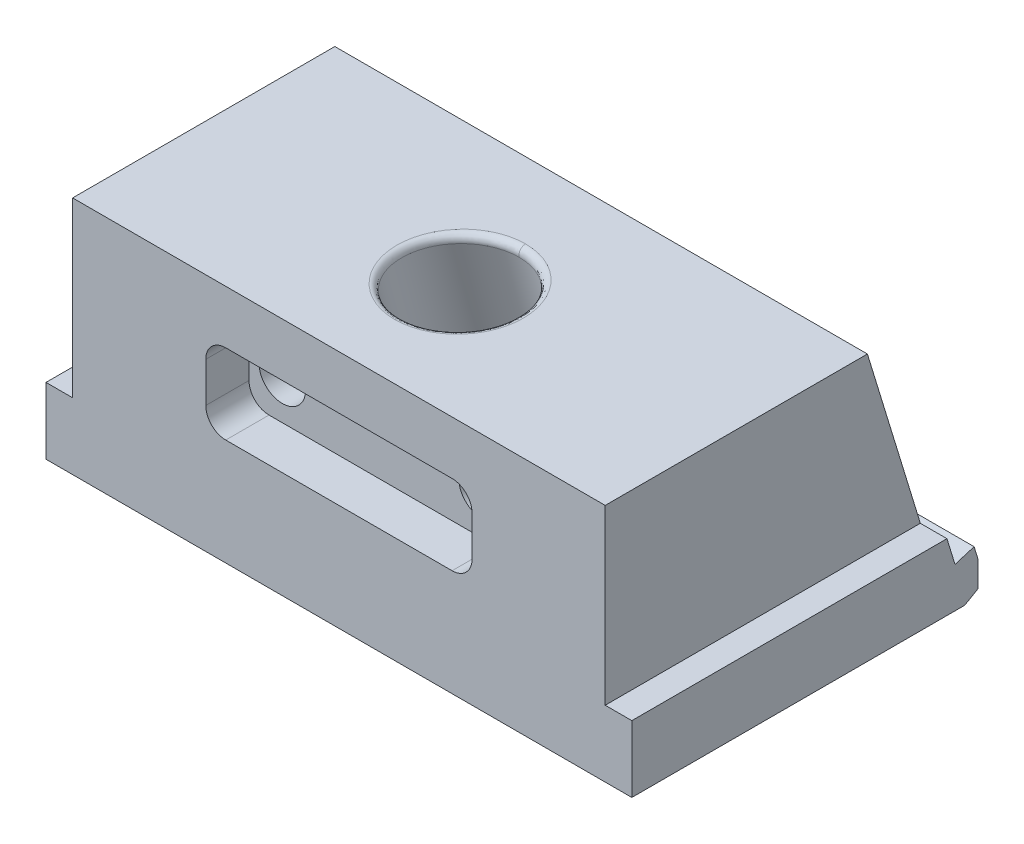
ISO-10303-21;
HEADER;
FILE_DESCRIPTION(('STEP AP214'),'2;1');
FILE_NAME('part.step','',(''),(''),'','','');
FILE_SCHEMA(('AUTOMOTIVE_DESIGN { 1 0 10303 214 1 1 1 1 }'));
ENDSEC;
DATA;
#1=APPLICATION_CONTEXT('core data for automotive mechanical design processes');
#2=APPLICATION_PROTOCOL_DEFINITION('international standard','automotive_design',2000,#1);
#3=PRODUCT_CONTEXT('',#1,'mechanical');
#4=PRODUCT('Part','Part','',(#3));
#5=PRODUCT_RELATED_PRODUCT_CATEGORY('part','',(#4));
#6=PRODUCT_DEFINITION_FORMATION('','',#4);
#7=PRODUCT_DEFINITION_CONTEXT('part definition',#1,'design');
#8=PRODUCT_DEFINITION('design','',#6,#7);
#9=PRODUCT_DEFINITION_SHAPE('','',#8);
#10=(LENGTH_UNIT() NAMED_UNIT(*) SI_UNIT(.MILLI.,.METRE.));
#11=(NAMED_UNIT(*) PLANE_ANGLE_UNIT() SI_UNIT($,.RADIAN.));
#12=(NAMED_UNIT(*) SI_UNIT($,.STERADIAN.) SOLID_ANGLE_UNIT());
#13=UNCERTAINTY_MEASURE_WITH_UNIT(LENGTH_MEASURE(1.E-05),#10,'distance_accuracy_value','');
#14=(GEOMETRIC_REPRESENTATION_CONTEXT(3) GLOBAL_UNCERTAINTY_ASSIGNED_CONTEXT((#13)) GLOBAL_UNIT_ASSIGNED_CONTEXT((#10,
#11,#12)) REPRESENTATION_CONTEXT('',''));
#15=CARTESIAN_POINT('',(0.,0.,0.));
#16=DIRECTION('',(0.,0.,1.));
#17=DIRECTION('',(1.,0.,0.));
#18=AXIS2_PLACEMENT_3D('',#15,#16,#17);
#19=CARTESIAN_POINT('',(28.,-7.35257648,-49.094224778));
#20=DIRECTION('',(0.,0.292371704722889,-0.956304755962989));
#21=DIRECTION('',(0.,0.956304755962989,0.292371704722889));
#22=AXIS2_PLACEMENT_3D('',#19,#20,#21);
#23=CONICAL_SURFACE('',#22,0.,1.04719755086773);
#24=CARTESIAN_POINT('',(28.,-7.3525764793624,-49.0942247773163));
#25=VERTEX_POINT('',#24);
#26=VERTEX_LOOP('',#25);
#27=FACE_BOUND('',#26,.T.);
#28=CARTESIAN_POINT('',(28.,-6.93057427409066,-50.474531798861));
#29=DIRECTION('',(0.,-0.292371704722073,0.956304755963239));
#30=DIRECTION('',(0.,0.956304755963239,0.29237170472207));
#31=AXIS2_PLACEMENT_3D('',#28,#29,#30);
#32=CIRCLE('',#31,2.5000000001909);
#33=CARTESIAN_POINT('',(28.,-4.539812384,-49.743602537));
#34=VERTEX_POINT('',#33);
#35=EDGE_CURVE('E349',#34,#34,#32,.T.);
#36=ORIENTED_EDGE('',*,*,#35,.F.);
#37=EDGE_LOOP('',(#36));
#38=FACE_BOUND('',#37,.T.);
#39=ADVANCED_FACE('F24',(#27,#38),#23,.F.);
#40=CARTESIAN_POINT('',(-28.,-7.35257648,-49.094224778));
#41=DIRECTION('',(0.,0.292371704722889,-0.956304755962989));
#42=DIRECTION('',(0.,0.956304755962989,0.292371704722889));
#43=AXIS2_PLACEMENT_3D('',#40,#41,#42);
#44=CONICAL_SURFACE('',#43,0.,1.04719755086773);
#45=CARTESIAN_POINT('',(-28.,-7.35257647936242,-49.0942247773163));
#46=VERTEX_POINT('',#45);
#47=VERTEX_LOOP('',#46);
#48=FACE_BOUND('',#47,.T.);
#49=CARTESIAN_POINT('',(-28.,-6.93057427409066,-50.474531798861));
#50=DIRECTION('',(0.,-0.292371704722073,0.956304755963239));
#51=DIRECTION('',(0.,0.956304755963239,0.29237170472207));
#52=AXIS2_PLACEMENT_3D('',#49,#50,#51);
#53=CIRCLE('',#52,2.5000000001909);
#54=CARTESIAN_POINT('',(-28.,-4.539812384,-49.743602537));
#55=VERTEX_POINT('',#54);
#56=EDGE_CURVE('E345',#55,#55,#53,.T.);
#57=ORIENTED_EDGE('',*,*,#56,.F.);
#58=EDGE_LOOP('',(#57));
#59=FACE_BOUND('',#58,.T.);
#60=ADVANCED_FACE('F639',(#48,#59),#44,.F.);
#61=CARTESIAN_POINT('',(-9.434,-5.566,-55.5));
#62=DIRECTION('',(0.,0.,1.));
#63=DIRECTION('',(0.,1.,0.));
#64=AXIS2_PLACEMENT_3D('',#61,#62,#63);
#65=PLANE('',#64);
#66=CARTESIAN_POINT('',(-15.,0.,-55.5));
#67=DIRECTION('',(0.,0.,-1.));
#68=DIRECTION('',(-1.,0.,0.));
#69=AXIS2_PLACEMENT_3D('',#66,#67,#68);
#70=CIRCLE('',#69,3.5);
#71=CARTESIAN_POINT('',(-18.5,0.,-55.5));
#72=VERTEX_POINT('',#71);
#73=EDGE_CURVE('E350',#72,#72,#70,.T.);
#74=ORIENTED_EDGE('',*,*,#73,.F.);
#75=EDGE_LOOP('',(#74));
#76=FACE_BOUND('',#75,.T.);
#77=CARTESIAN_POINT('',(-15.,0.,-55.5));
#78=DIRECTION('',(0.,0.,-1.));
#79=DIRECTION('',(-1.,0.,0.));
#80=AXIS2_PLACEMENT_3D('',#77,#78,#79);
#81=CIRCLE('',#80,5.5);
#82=CARTESIAN_POINT('',(-20.5,0.,-55.5));
#83=VERTEX_POINT('',#82);
#84=EDGE_CURVE('E342',#83,#83,#81,.F.);
#85=ORIENTED_EDGE('',*,*,#84,.F.);
#86=EDGE_LOOP('',(#85));
#87=FACE_BOUND('',#86,.T.);
#88=ADVANCED_FACE('F642',(#76,#87),#65,.F.);
#89=CARTESIAN_POINT('',(20.566,-5.566,-55.5));
#90=DIRECTION('',(0.,0.,1.));
#91=DIRECTION('',(0.,1.,0.));
#92=AXIS2_PLACEMENT_3D('',#89,#90,#91);
#93=PLANE('',#92);
#94=CARTESIAN_POINT('',(15.,0.,-55.5));
#95=DIRECTION('',(0.,0.,-1.));
#96=DIRECTION('',(-1.,0.,0.));
#97=AXIS2_PLACEMENT_3D('',#94,#95,#96);
#98=CIRCLE('',#97,3.5);
#99=CARTESIAN_POINT('',(11.5,0.,-55.5));
#100=VERTEX_POINT('',#99);
#101=EDGE_CURVE('E346',#100,#100,#98,.T.);
#102=ORIENTED_EDGE('',*,*,#101,.F.);
#103=EDGE_LOOP('',(#102));
#104=FACE_BOUND('',#103,.T.);
#105=CARTESIAN_POINT('',(15.,0.,-55.5));
#106=DIRECTION('',(0.,0.,-1.));
#107=DIRECTION('',(-1.,0.,0.));
#108=AXIS2_PLACEMENT_3D('',#105,#106,#107);
#109=CIRCLE('',#108,5.5);
#110=CARTESIAN_POINT('',(9.5,0.,-55.5));
#111=VERTEX_POINT('',#110);
#112=EDGE_CURVE('E339',#111,#111,#109,.F.);
#113=ORIENTED_EDGE('',*,*,#112,.F.);
#114=EDGE_LOOP('',(#113));
#115=FACE_BOUND('',#114,.T.);
#116=ADVANCED_FACE('F637',(#104,#115),#93,.F.);
#117=CARTESIAN_POINT('',(-15.,0.,-28.5));
#118=DIRECTION('',(0.,0.,-1.));
#119=DIRECTION('',(-1.,0.,0.));
#120=AXIS2_PLACEMENT_3D('',#117,#118,#119);
#121=CYLINDRICAL_SURFACE('',#120,3.5);
#122=CARTESIAN_POINT('',(-15.,0.,-28.5));
#123=DIRECTION('',(0.,0.,-1.));
#124=DIRECTION('',(-1.,0.,0.));
#125=AXIS2_PLACEMENT_3D('',#122,#123,#124);
#126=CIRCLE('',#125,3.5);
#127=CARTESIAN_POINT('',(-18.5,0.,-28.5));
#128=VERTEX_POINT('',#127);
#129=EDGE_CURVE('E336',#128,#128,#126,.F.);
#130=ORIENTED_EDGE('',*,*,#129,.T.);
#131=EDGE_LOOP('',(#130));
#132=FACE_BOUND('',#131,.T.);
#133=ORIENTED_EDGE('',*,*,#73,.T.);
#134=EDGE_LOOP('',(#133));
#135=FACE_BOUND('',#134,.T.);
#136=ADVANCED_FACE('F633',(#132,#135),#121,.F.);
#137=CARTESIAN_POINT('',(15.,0.,-28.5));
#138=DIRECTION('',(0.,0.,-1.));
#139=DIRECTION('',(-1.,0.,0.));
#140=AXIS2_PLACEMENT_3D('',#137,#138,#139);
#141=CYLINDRICAL_SURFACE('',#140,3.5);
#142=CARTESIAN_POINT('',(15.,0.,-28.5));
#143=DIRECTION('',(0.,0.,-1.));
#144=DIRECTION('',(-1.,0.,0.));
#145=AXIS2_PLACEMENT_3D('',#142,#143,#144);
#146=CIRCLE('',#145,3.5);
#147=CARTESIAN_POINT('',(11.5,0.,-28.5));
#148=VERTEX_POINT('',#147);
#149=EDGE_CURVE('E250',#148,#148,#146,.F.);
#150=ORIENTED_EDGE('',*,*,#149,.T.);
#151=EDGE_LOOP('',(#150));
#152=FACE_BOUND('',#151,.T.);
#153=ORIENTED_EDGE('',*,*,#101,.T.);
#154=EDGE_LOOP('',(#153));
#155=FACE_BOUND('',#154,.T.);
#156=ADVANCED_FACE('F629',(#152,#155),#141,.F.);
#157=CARTESIAN_POINT('',(28.,-2.08988579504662,-66.3077103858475));
#158=DIRECTION('',(0.,-0.292371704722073,0.956304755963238));
#159=DIRECTION('',(0.,-0.956304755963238,-0.292371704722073));
#160=AXIS2_PLACEMENT_3D('',#157,#158,#159);
#161=CYLINDRICAL_SURFACE('',#160,2.50000000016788);
#162=CARTESIAN_POINT('',(28.,-2.08988579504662,-66.3077103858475));
#163=DIRECTION('',(0.,-0.292371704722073,0.956304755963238));
#164=DIRECTION('',(0.,-0.956304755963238,-0.292371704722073));
#165=AXIS2_PLACEMENT_3D('',#162,#163,#164);
#166=CIRCLE('',#165,2.50000000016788);
#167=CARTESIAN_POINT('',(28.,-4.48064768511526,-67.0386396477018));
#168=VERTEX_POINT('',#167);
#169=EDGE_CURVE('E245',#168,#168,#166,.F.);
#170=ORIENTED_EDGE('',*,*,#169,.T.);
#171=EDGE_LOOP('',(#170));
#172=FACE_BOUND('',#171,.T.);
#173=ORIENTED_EDGE('',*,*,#35,.T.);
#174=EDGE_LOOP('',(#173));
#175=FACE_BOUND('',#174,.T.);
#176=ADVANCED_FACE('F625',(#172,#175),#161,.F.);
#177=CARTESIAN_POINT('',(-28.,-2.08988579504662,-66.3077103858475));
#178=DIRECTION('',(0.,-0.292371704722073,0.956304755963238));
#179=DIRECTION('',(0.,-0.956304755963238,-0.292371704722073));
#180=AXIS2_PLACEMENT_3D('',#177,#178,#179);
#181=CYLINDRICAL_SURFACE('',#180,2.50000000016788);
#182=CARTESIAN_POINT('',(-28.,-2.08988579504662,-66.3077103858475));
#183=DIRECTION('',(0.,-0.292371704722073,0.956304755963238));
#184=DIRECTION('',(0.,-0.956304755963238,-0.292371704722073));
#185=AXIS2_PLACEMENT_3D('',#182,#183,#184);
#186=CIRCLE('',#185,2.50000000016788);
#187=CARTESIAN_POINT('',(-28.,-4.48064768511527,-67.0386396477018));
#188=VERTEX_POINT('',#187);
#189=EDGE_CURVE('E329',#188,#188,#186,.F.);
#190=ORIENTED_EDGE('',*,*,#189,.T.);
#191=EDGE_LOOP('',(#190));
#192=FACE_BOUND('',#191,.T.);
#193=ORIENTED_EDGE('',*,*,#56,.T.);
#194=EDGE_LOOP('',(#193));
#195=FACE_BOUND('',#194,.T.);
#196=ADVANCED_FACE('F621',(#192,#195),#181,.F.);
#197=CARTESIAN_POINT('',(-15.,0.,-55.5));
#198=DIRECTION('',(0.,0.,-1.));
#199=DIRECTION('',(-1.,0.,0.));
#200=AXIS2_PLACEMENT_3D('',#197,#198,#199);
#201=CYLINDRICAL_SURFACE('',#200,5.5);
#202=ORIENTED_EDGE('',*,*,#84,.T.);
#203=EDGE_LOOP('',(#202));
#204=FACE_BOUND('',#203,.T.);
#205=CARTESIAN_POINT('',(-15.,0.,-65.6687681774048));
#206=DIRECTION('',(0.,-0.292371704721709,0.95630475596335));
#207=DIRECTION('',(0.,-0.95630475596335,-0.292371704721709));
#208=AXIS2_PLACEMENT_3D('',#205,#206,#207);
#209=ELLIPSE('',#208,5.75130466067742,5.5);
#210=CARTESIAN_POINT('',(-15.,-5.5,-67.350286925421));
#211=VERTEX_POINT('',#210);
#212=EDGE_CURVE('E326',#211,#211,#209,.F.);
#213=ORIENTED_EDGE('',*,*,#212,.T.);
#214=EDGE_LOOP('',(#213));
#215=FACE_BOUND('',#214,.T.);
#216=ADVANCED_FACE('F617',(#204,#215),#201,.F.);
#217=CARTESIAN_POINT('',(15.,0.,-55.5));
#218=DIRECTION('',(0.,0.,-1.));
#219=DIRECTION('',(-1.,0.,0.));
#220=AXIS2_PLACEMENT_3D('',#217,#218,#219);
#221=CYLINDRICAL_SURFACE('',#220,5.5);
#222=ORIENTED_EDGE('',*,*,#112,.T.);
#223=EDGE_LOOP('',(#222));
#224=FACE_BOUND('',#223,.T.);
#225=CARTESIAN_POINT('',(15.,0.,-65.6687681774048));
#226=DIRECTION('',(0.,-0.292371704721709,0.95630475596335));
#227=DIRECTION('',(0.,-0.95630475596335,-0.292371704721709));
#228=AXIS2_PLACEMENT_3D('',#225,#226,#227);
#229=ELLIPSE('',#228,5.75130466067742,5.5);
#230=CARTESIAN_POINT('',(15.,-5.5,-67.350286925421));
#231=VERTEX_POINT('',#230);
#232=EDGE_CURVE('E323',#231,#231,#229,.F.);
#233=ORIENTED_EDGE('',*,*,#232,.T.);
#234=EDGE_LOOP('',(#233));
#235=FACE_BOUND('',#234,.T.);
#236=ADVANCED_FACE('F614',(#224,#235),#221,.F.);
#237=CARTESIAN_POINT('',(20.,6.,-28.5));
#238=DIRECTION('',(0.,0.,-1.));
#239=DIRECTION('',(0.,-1.,0.));
#240=AXIS2_PLACEMENT_3D('',#237,#238,#239);
#241=PLANE('',#240);
#242=ORIENTED_EDGE('',*,*,#149,.F.);
#243=EDGE_LOOP('',(#242));
#244=FACE_BOUND('',#243,.T.);
#245=ORIENTED_EDGE('',*,*,#129,.F.);
#246=EDGE_LOOP('',(#245));
#247=FACE_BOUND('',#246,.T.);
#248=CARTESIAN_POINT('',(17.,3.,-28.5));
#249=DIRECTION('',(0.,0.,1.));
#250=DIRECTION('',(0.,-1.,0.));
#251=AXIS2_PLACEMENT_3D('',#248,#249,#250);
#252=CIRCLE('',#251,3.);
#253=CARTESIAN_POINT('',(17.,6.,-28.5));
#254=VERTEX_POINT('',#253);
#255=CARTESIAN_POINT('',(20.,3.,-28.5));
#256=VERTEX_POINT('',#255);
#257=EDGE_CURVE('E308',#254,#256,#252,.F.);
#258=ORIENTED_EDGE('',*,*,#257,.F.);
#259=DIRECTION('',(1.,0.,0.));
#260=VECTOR('',#259,1.);
#261=CARTESIAN_POINT('',(0.,6.,-28.5));
#262=LINE('',#261,#260);
#263=CARTESIAN_POINT('',(-17.,6.,-28.5));
#264=VERTEX_POINT('',#263);
#265=EDGE_CURVE('E420',#264,#254,#262,.T.);
#266=ORIENTED_EDGE('',*,*,#265,.F.);
#267=CARTESIAN_POINT('',(-17.,3.,-28.5));
#268=DIRECTION('',(0.,0.,1.));
#269=DIRECTION('',(0.,-1.,0.));
#270=AXIS2_PLACEMENT_3D('',#267,#268,#269);
#271=CIRCLE('',#270,3.);
#272=CARTESIAN_POINT('',(-20.,3.,-28.5));
#273=VERTEX_POINT('',#272);
#274=EDGE_CURVE('E241',#273,#264,#271,.F.);
#275=ORIENTED_EDGE('',*,*,#274,.F.);
#276=DIRECTION('',(0.,1.,0.));
#277=VECTOR('',#276,1.);
#278=CARTESIAN_POINT('',(-20.,0.,-28.5));
#279=LINE('',#278,#277);
#280=CARTESIAN_POINT('',(-20.,-3.00000000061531,-28.5));
#281=VERTEX_POINT('',#280);
#282=EDGE_CURVE('E321',#281,#273,#279,.T.);
#283=ORIENTED_EDGE('',*,*,#282,.F.);
#284=CARTESIAN_POINT('',(-17.,-3.,-28.5));
#285=DIRECTION('',(0.,0.,1.));
#286=DIRECTION('',(0.,-1.,0.));
#287=AXIS2_PLACEMENT_3D('',#284,#285,#286);
#288=CIRCLE('',#287,3.);
#289=CARTESIAN_POINT('',(-17.,-6.,-28.5));
#290=VERTEX_POINT('',#289);
#291=EDGE_CURVE('E316',#290,#281,#288,.F.);
#292=ORIENTED_EDGE('',*,*,#291,.F.);
#293=DIRECTION('',(-1.,0.,0.));
#294=VECTOR('',#293,1.);
#295=CARTESIAN_POINT('',(0.,-6.,-28.5));
#296=LINE('',#295,#294);
#297=CARTESIAN_POINT('',(16.999999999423,-6.,-28.5));
#298=VERTEX_POINT('',#297);
#299=EDGE_CURVE('E430',#298,#290,#296,.T.);
#300=ORIENTED_EDGE('',*,*,#299,.F.);
#301=CARTESIAN_POINT('',(17.,-3.,-28.5));
#302=DIRECTION('',(0.,0.,1.));
#303=DIRECTION('',(0.,-1.,0.));
#304=AXIS2_PLACEMENT_3D('',#301,#302,#303);
#305=CIRCLE('',#304,3.);
#306=CARTESIAN_POINT('',(20.,-3.,-28.5));
#307=VERTEX_POINT('',#306);
#308=EDGE_CURVE('E312',#307,#298,#305,.F.);
#309=ORIENTED_EDGE('',*,*,#308,.F.);
#310=DIRECTION('',(0.,-1.,0.));
#311=VECTOR('',#310,1.);
#312=CARTESIAN_POINT('',(20.,0.,-28.5));
#313=LINE('',#312,#311);
#314=EDGE_CURVE('E428',#256,#307,#313,.T.);
#315=ORIENTED_EDGE('',*,*,#314,.F.);
#316=EDGE_LOOP('',(#258,#266,#275,#283,#292,#300,#309,#315));
#317=FACE_BOUND('',#316,.T.);
#318=ADVANCED_FACE('F592',(#244,#247,#317),#241,.F.);
#319=CARTESIAN_POINT('',(-44.,-16.989320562,-74.));
#320=DIRECTION('',(0.,0.,-1.));
#321=DIRECTION('',(1.,0.,0.));
#322=AXIS2_PLACEMENT_3D('',#319,#320,#321);
#323=PLANE('',#322);
#324=DIRECTION('',(0.,-1.,0.));
#325=VECTOR('',#324,1.);
#326=CARTESIAN_POINT('',(-44.,-17.,-74.));
#327=LINE('',#326,#325);
#328=CARTESIAN_POINT('',(-44.,-16.989320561,-74.));
#329=VERTEX_POINT('',#328);
#330=CARTESIAN_POINT('',(-44.,-20.8452994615,-74.));
#331=VERTEX_POINT('',#330);
#332=EDGE_CURVE('E251',#329,#331,#327,.T.);
#333=ORIENTED_EDGE('',*,*,#332,.F.);
#334=DIRECTION('',(-1.,0.,0.));
#335=VECTOR('',#334,1.);
#336=CARTESIAN_POINT('',(0.,-16.989320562,-74.));
#337=LINE('',#336,#335);
#338=CARTESIAN_POINT('',(44.,-16.989320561,-74.));
#339=VERTEX_POINT('',#338);
#340=EDGE_CURVE('E248',#339,#329,#337,.T.);
#341=ORIENTED_EDGE('',*,*,#340,.F.);
#342=DIRECTION('',(0.,1.,0.));
#343=VECTOR('',#342,1.);
#344=CARTESIAN_POINT('',(44.,-17.,-74.));
#345=LINE('',#344,#343);
#346=CARTESIAN_POINT('',(44.,-20.845299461,-74.));
#347=VERTEX_POINT('',#346);
#348=EDGE_CURVE('E268',#347,#339,#345,.T.);
#349=ORIENTED_EDGE('',*,*,#348,.F.);
#350=DIRECTION('',(-1.,0.,0.));
#351=VECTOR('',#350,1.);
#352=CARTESIAN_POINT('',(0.,-20.845299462,-74.));
#353=LINE('',#352,#351);
#354=EDGE_CURVE('E263',#347,#331,#353,.T.);
#355=ORIENTED_EDGE('',*,*,#354,.T.);
#356=EDGE_LOOP('',(#333,#341,#349,#355));
#357=FACE_BOUND('',#356,.T.);
#358=ADVANCED_FACE('F501',(#357),#323,.T.);
#359=CARTESIAN_POINT('',(44.,-15.079189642,-73.416014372));
#360=DIRECTION('',(0.,0.292371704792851,-0.956304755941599));
#361=DIRECTION('',(0.,-0.956304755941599,-0.292371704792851));
#362=AXIS2_PLACEMENT_3D('',#359,#360,#361);
#363=PLANE('',#362);
#364=DIRECTION('',(0.,0.95630475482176,0.292371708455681));
#365=VECTOR('',#364,1.);
#366=CARTESIAN_POINT('',(44.,-16.98932056,-74.));
#367=LINE('',#366,#365);
#368=CARTESIAN_POINT('',(44.,-15.0791896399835,-73.4160143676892));
#369=VERTEX_POINT('',#368);
#370=EDGE_CURVE('E270',#339,#369,#367,.T.);
#371=ORIENTED_EDGE('',*,*,#370,.F.);
#372=ORIENTED_EDGE('',*,*,#340,.T.);
#373=DIRECTION('',(0.,-0.95630475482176,-0.29237170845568));
#374=VECTOR('',#373,1.);
#375=CARTESIAN_POINT('',(-44.,-15.07918964,-73.416014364));
#376=LINE('',#375,#374);
#377=CARTESIAN_POINT('',(-44.,-15.0791896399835,-73.4160143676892));
#378=VERTEX_POINT('',#377);
#379=EDGE_CURVE('E267',#378,#329,#376,.T.);
#380=ORIENTED_EDGE('',*,*,#379,.F.);
#381=DIRECTION('',(-1.,0.,0.));
#382=VECTOR('',#381,1.);
#383=CARTESIAN_POINT('',(0.,-15.079189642,-73.416014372));
#384=LINE('',#383,#382);
#385=EDGE_CURVE('E246',#369,#378,#384,.T.);
#386=ORIENTED_EDGE('',*,*,#385,.F.);
#387=EDGE_LOOP('',(#371,#372,#380,#386));
#388=FACE_BOUND('',#387,.T.);
#389=ADVANCED_FACE('F497',(#388),#363,.T.);
#390=CARTESIAN_POINT('',(-44.,-15.079189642,-73.416014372));
#391=DIRECTION('',(0.,0.956304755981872,0.292371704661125));
#392=DIRECTION('',(0.,-0.292371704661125,0.956304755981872));
#393=AXIS2_PLACEMENT_3D('',#390,#391,#392);
#394=PLANE('',#393);
#395=ORIENTED_EDGE('',*,*,#385,.T.);
#396=DIRECTION('',(0.,0.29237170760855,-0.956304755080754));
#397=VECTOR('',#396,1.);
#398=CARTESIAN_POINT('',(-44.,-15.95630476,-70.547100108));
#399=LINE('',#398,#397);
#400=CARTESIAN_POINT('',(-44.,-15.9563047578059,-70.5471001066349));
#401=VERTEX_POINT('',#400);
#402=EDGE_CURVE('E303',#401,#378,#399,.T.);
#403=ORIENTED_EDGE('',*,*,#402,.F.);
#404=DIRECTION('',(1.,0.,0.));
#405=VECTOR('',#404,1.);
#406=CARTESIAN_POINT('',(0.,-15.956304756,-70.547100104));
#407=LINE('',#406,#405);
#408=CARTESIAN_POINT('',(44.,-15.9563047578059,-70.5471001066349));
#409=VERTEX_POINT('',#408);
#410=EDGE_CURVE('E242',#401,#409,#407,.T.);
#411=ORIENTED_EDGE('',*,*,#410,.T.);
#412=DIRECTION('',(0.,-0.292371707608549,0.956304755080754));
#413=VECTOR('',#412,1.);
#414=CARTESIAN_POINT('',(44.,-15.07918964,-73.416014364));
#415=LINE('',#414,#413);
#416=EDGE_CURVE('E296',#369,#409,#415,.T.);
#417=ORIENTED_EDGE('',*,*,#416,.F.);
#418=EDGE_LOOP('',(#395,#403,#411,#417));
#419=FACE_BOUND('',#418,.T.);
#420=ADVANCED_FACE('F493',(#419),#394,.T.);
#421=CARTESIAN_POINT('',(-44.,-15.956304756,-70.547100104));
#422=DIRECTION('',(0.,-0.292371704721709,0.95630475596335));
#423=DIRECTION('',(1.,0.,0.));
#424=AXIS2_PLACEMENT_3D('',#421,#422,#423);
#425=PLANE('',#424);
#426=ORIENTED_EDGE('',*,*,#232,.F.);
#427=EDGE_LOOP('',(#426));
#428=FACE_BOUND('',#427,.T.);
#429=ORIENTED_EDGE('',*,*,#212,.F.);
#430=EDGE_LOOP('',(#429));
#431=FACE_BOUND('',#430,.T.);
#432=ORIENTED_EDGE('',*,*,#189,.F.);
#433=EDGE_LOOP('',(#432));
#434=FACE_BOUND('',#433,.T.);
#435=ORIENTED_EDGE('',*,*,#169,.F.);
#436=EDGE_LOOP('',(#435));
#437=FACE_BOUND('',#436,.T.);
#438=DIRECTION('',(-1.,0.,0.));
#439=VECTOR('',#438,1.);
#440=CARTESIAN_POINT('',(-42.,-12.,-69.337536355));
#441=LINE('',#440,#439);
#442=CARTESIAN_POINT('',(-40.0000000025,-12.0000000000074,-69.3375363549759));
#443=VERTEX_POINT('',#442);
#444=CARTESIAN_POINT('',(-44.,-12.,-69.3375363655));
#445=VERTEX_POINT('',#444);
#446=EDGE_CURVE('E176',#443,#445,#441,.T.);
#447=ORIENTED_EDGE('',*,*,#446,.F.);
#448=DIRECTION('',(0.,0.95630475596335,0.292371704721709));
#449=VECTOR('',#448,1.);
#450=CARTESIAN_POINT('',(-40.000000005,-15.956304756,-70.547100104));
#451=LINE('',#450,#449);
#452=CARTESIAN_POINT('',(-40.0000000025,14.,-61.388538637));
#453=VERTEX_POINT('',#452);
#454=EDGE_CURVE('E178',#443,#453,#451,.T.);
#455=ORIENTED_EDGE('',*,*,#454,.T.);
#456=DIRECTION('',(1.,0.,0.));
#457=VECTOR('',#456,1.);
#458=CARTESIAN_POINT('',(0.,14.,-61.388538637));
#459=LINE('',#458,#457);
#460=CARTESIAN_POINT('',(40.0000000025,14.,-61.388538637));
#461=VERTEX_POINT('',#460);
#462=EDGE_CURVE('E182',#453,#461,#459,.T.);
#463=ORIENTED_EDGE('',*,*,#462,.T.);
#464=DIRECTION('',(0.,0.95630475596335,0.292371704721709));
#465=VECTOR('',#464,1.);
#466=CARTESIAN_POINT('',(40.000000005,-15.956304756,-70.547100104));
#467=LINE('',#466,#465);
#468=CARTESIAN_POINT('',(40.0000000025,-12.0000000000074,-69.3375363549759));
#469=VERTEX_POINT('',#468);
#470=EDGE_CURVE('E236',#461,#469,#467,.F.);
#471=ORIENTED_EDGE('',*,*,#470,.T.);
#472=DIRECTION('',(-1.,0.,0.));
#473=VECTOR('',#472,1.);
#474=CARTESIAN_POINT('',(42.,-12.,-69.337536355));
#475=LINE('',#474,#473);
#476=CARTESIAN_POINT('',(44.,-12.,-69.3375363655));
#477=VERTEX_POINT('',#476);
#478=EDGE_CURVE('E237',#477,#469,#475,.T.);
#479=ORIENTED_EDGE('',*,*,#478,.F.);
#480=DIRECTION('',(0.,0.956304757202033,0.292371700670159));
#481=VECTOR('',#480,1.);
#482=CARTESIAN_POINT('',(44.,-15.95630476,-70.547100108));
#483=LINE('',#482,#481);
#484=EDGE_CURVE('E274',#409,#477,#483,.T.);
#485=ORIENTED_EDGE('',*,*,#484,.F.);
#486=ORIENTED_EDGE('',*,*,#410,.F.);
#487=DIRECTION('',(0.,-0.956304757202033,-0.292371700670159));
#488=VECTOR('',#487,1.);
#489=CARTESIAN_POINT('',(-44.,-12.,-69.337536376));
#490=LINE('',#489,#488);
#491=EDGE_CURVE('E256',#445,#401,#490,.T.);
#492=ORIENTED_EDGE('',*,*,#491,.F.);
#493=EDGE_LOOP('',(#447,#455,#463,#471,#479,#485,#486,#492));
#494=FACE_BOUND('',#493,.T.);
#495=ADVANCED_FACE('F180',(#428,#431,#434,#437,#494),#425,.F.);
#496=CARTESIAN_POINT('',(-40.,-12.,-69.337536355));
#497=DIRECTION('',(0.,1.,0.));
#498=DIRECTION('',(-1.,0.,0.));
#499=AXIS2_PLACEMENT_3D('',#496,#497,#498);
#500=PLANE('',#499);
#501=DIRECTION('',(1.,0.,0.));
#502=VECTOR('',#501,1.);
#503=CARTESIAN_POINT('',(0.,-11.999999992,-22.));
#504=LINE('',#503,#502);
#505=CARTESIAN_POINT('',(-44.,-11.999999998,-22.));
#506=VERTEX_POINT('',#505);
#507=CARTESIAN_POINT('',(-40.00000001,-11.999999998,-22.));
#508=VERTEX_POINT('',#507);
#509=EDGE_CURVE('E441',#506,#508,#504,.T.);
#510=ORIENTED_EDGE('',*,*,#509,.T.);
#511=DIRECTION('',(0.,0.,-1.));
#512=VECTOR('',#511,1.);
#513=CARTESIAN_POINT('',(-40.,-12.,-45.8107807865));
#514=LINE('',#513,#512);
#515=EDGE_CURVE('E188',#508,#443,#514,.T.);
#516=ORIENTED_EDGE('',*,*,#515,.T.);
#517=ORIENTED_EDGE('',*,*,#446,.T.);
#518=DIRECTION('',(0.,0.,-1.));
#519=VECTOR('',#518,1.);
#520=CARTESIAN_POINT('',(-44.,-12.,-48.));
#521=LINE('',#520,#519);
#522=EDGE_CURVE('E253',#506,#445,#521,.T.);
#523=ORIENTED_EDGE('',*,*,#522,.F.);
#524=EDGE_LOOP('',(#510,#516,#517,#523));
#525=FACE_BOUND('',#524,.T.);
#526=ADVANCED_FACE('F439',(#525),#500,.T.);
#527=CARTESIAN_POINT('',(-40.,14.,-22.));
#528=DIRECTION('',(1.,0.,0.));
#529=DIRECTION('',(0.,-1.,0.));
#530=AXIS2_PLACEMENT_3D('',#527,#528,#529);
#531=PLANE('',#530);
#532=ORIENTED_EDGE('',*,*,#454,.F.);
#533=ORIENTED_EDGE('',*,*,#515,.F.);
#534=DIRECTION('',(0.,1.,0.));
#535=VECTOR('',#534,1.);
#536=CARTESIAN_POINT('',(-40.00000004,-4.,-22.));
#537=LINE('',#536,#535);
#538=CARTESIAN_POINT('',(-40.00000001,14.,-22.));
#539=VERTEX_POINT('',#538);
#540=EDGE_CURVE('E200',#508,#539,#537,.T.);
#541=ORIENTED_EDGE('',*,*,#540,.T.);
#542=DIRECTION('',(0.,0.,-1.));
#543=VECTOR('',#542,1.);
#544=CARTESIAN_POINT('',(-40.,14.,-41.6942693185));
#545=LINE('',#544,#543);
#546=EDGE_CURVE('E187',#539,#453,#545,.T.);
#547=ORIENTED_EDGE('',*,*,#546,.T.);
#548=EDGE_LOOP('',(#532,#533,#541,#547));
#549=FACE_BOUND('',#548,.T.);
#550=ADVANCED_FACE('F198',(#549),#531,.F.);
#551=CARTESIAN_POINT('',(40.,14.,-22.));
#552=DIRECTION('',(0.,-1.,0.));
#553=DIRECTION('',(-1.,0.,0.));
#554=AXIS2_PLACEMENT_3D('',#551,#552,#553);
#555=PLANE('',#554);
#556=CARTESIAN_POINT('',(0.,14.,-50.036430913));
#557=CARTESIAN_POINT('',(-0.621780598,14.,-50.036430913));
#558=CARTESIAN_POINT('',(-1.243531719,14.,-49.973032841));
#559=CARTESIAN_POINT('',(-2.4631844,14.,-49.721870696));
#560=CARTESIAN_POINT('',(-3.061048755,14.,-49.534112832));
#561=CARTESIAN_POINT('',(-4.209936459,14.,-49.041440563));
#562=CARTESIAN_POINT('',(-4.760931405,14.,-48.736538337));
#563=CARTESIAN_POINT('',(-5.794903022,14.,-48.021289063));
#564=CARTESIAN_POINT('',(-6.277854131,14.,-47.610959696));
#565=CARTESIAN_POINT('',(-7.157174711,14.,-46.700620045));
#566=CARTESIAN_POINT('',(-7.553522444,14.,-46.200632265));
#567=CARTESIAN_POINT('',(-8.24440019,14.,-45.130186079));
#568=CARTESIAN_POINT('',(-8.53891312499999,14.,-44.559754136));
#569=CARTESIAN_POINT('',(-9.01479799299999,14.,-43.370338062));
#570=CARTESIAN_POINT('',(-9.19615816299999,14.,-42.751383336));
#571=CARTESIAN_POINT('',(-9.43876216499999,14.,-41.488705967));
#572=CARTESIAN_POINT('',(-9.49999999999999,14.,-40.84501454));
#573=CARTESIAN_POINT('',(-9.49999999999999,14.,-39.557599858));
#574=CARTESIAN_POINT('',(-9.43876216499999,14.,-38.913908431));
#575=CARTESIAN_POINT('',(-9.19615816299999,14.,-37.651231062));
#576=CARTESIAN_POINT('',(-9.014797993,14.,-37.032276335));
#577=CARTESIAN_POINT('',(-8.53891312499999,14.,-35.842860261));
#578=CARTESIAN_POINT('',(-8.24440018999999,14.,-35.272428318));
#579=CARTESIAN_POINT('',(-7.553522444,14.,-34.201982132));
#580=CARTESIAN_POINT('',(-7.15717471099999,14.,-33.701994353));
#581=CARTESIAN_POINT('',(-6.277854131,14.,-32.791654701));
#582=CARTESIAN_POINT('',(-5.794903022,14.,-32.381325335));
#583=CARTESIAN_POINT('',(-4.760931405,14.,-31.66607606));
#584=CARTESIAN_POINT('',(-4.209936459,14.,-31.361173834));
#585=CARTESIAN_POINT('',(-3.061048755,14.,-30.868501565));
#586=CARTESIAN_POINT('',(-2.4631844,14.,-30.680743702));
#587=CARTESIAN_POINT('',(-1.243531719,14.,-30.429581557));
#588=CARTESIAN_POINT('',(-0.621780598,14.,-30.366183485));
#589=CARTESIAN_POINT('',(0.,14.,-30.366183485));
#590=(BOUNDED_CURVE() B_SPLINE_CURVE(3,(#556,#557,#558,#559,#560,#561,#562,#563,#564,#565,#566,
#567,#568,#569,#570,#571,#572,#573,#574,#575,#576,#577,#578,#579,#580,#581,#582,#583,#584,#585,
#586,#587,#588,#589),.UNSPECIFIED.,.F.,.F.) B_SPLINE_CURVE_WITH_KNOTS((4,2,2,2,2,2,2,2,2,2,2,2,
2,2,2,2,4),(3.14159265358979,3.33794219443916,3.53429173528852,3.73064127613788,
3.92699081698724,4.1233403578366,4.31968989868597,4.51603943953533,4.71238898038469,
4.90873852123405,5.10508806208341,5.30143760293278,5.49778714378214,5.6941366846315,
5.89048622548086,6.08683576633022,6.28318530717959),
.UNSPECIFIED.) CURVE() GEOMETRIC_REPRESENTATION_ITEM() RATIONAL_B_SPLINE_CURVE((0.999999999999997,
0.999999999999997,0.999999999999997,0.999999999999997,0.999999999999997,0.999999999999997,
0.999999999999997,0.999999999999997,0.999999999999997,0.999999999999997,0.999999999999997,
0.999999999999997,0.999999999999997,0.999999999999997,0.999999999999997,0.999999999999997,
0.999999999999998,0.999999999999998,0.999999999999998,0.999999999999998,0.999999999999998,
0.999999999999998,0.999999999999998,0.999999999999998,0.999999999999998,0.999999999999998,
0.999999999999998,0.999999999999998,0.999999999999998,0.999999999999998,0.999999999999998,
0.999999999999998,0.999999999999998,0.999999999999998)) REPRESENTATION_ITEM(''));
#591=CARTESIAN_POINT('',(-3.41224249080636E-10,14.0000000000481,-50.0364309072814));
#592=VERTEX_POINT('',#591);
#593=CARTESIAN_POINT('',(-7.79408007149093E-10,14.0000000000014,-30.3661834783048));
#594=VERTEX_POINT('',#593);
#595=EDGE_CURVE('E208',#592,#594,#590,.T.);
#596=ORIENTED_EDGE('',*,*,#595,.F.);
#597=CARTESIAN_POINT('',(0.,14.,-30.366183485));
#598=CARTESIAN_POINT('',(0.621780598,14.,-30.366183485));
#599=CARTESIAN_POINT('',(1.243531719,14.,-30.429581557));
#600=CARTESIAN_POINT('',(2.4631844,14.,-30.680743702));
#601=CARTESIAN_POINT('',(3.061048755,14.,-30.868501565));
#602=CARTESIAN_POINT('',(4.209936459,14.,-31.361173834));
#603=CARTESIAN_POINT('',(4.760931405,14.,-31.66607606));
#604=CARTESIAN_POINT('',(5.794903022,14.,-32.381325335));
#605=CARTESIAN_POINT('',(6.277854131,14.,-32.791654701));
#606=CARTESIAN_POINT('',(7.157174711,14.,-33.701994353));
#607=CARTESIAN_POINT('',(7.553522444,14.,-34.201982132));
#608=CARTESIAN_POINT('',(8.24440019,14.,-35.272428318));
#609=CARTESIAN_POINT('',(8.53891312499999,14.,-35.842860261));
#610=CARTESIAN_POINT('',(9.01479799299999,14.,-37.032276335));
#611=CARTESIAN_POINT('',(9.19615816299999,14.,-37.651231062));
#612=CARTESIAN_POINT('',(9.43876216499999,14.,-38.913908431));
#613=CARTESIAN_POINT('',(9.49999999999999,14.,-39.557599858));
#614=CARTESIAN_POINT('',(9.49999999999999,14.,-40.84501454));
#615=CARTESIAN_POINT('',(9.43876216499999,14.,-41.488705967));
#616=CARTESIAN_POINT('',(9.19615816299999,14.,-42.751383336));
#617=CARTESIAN_POINT('',(9.014797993,14.,-43.370338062));
#618=CARTESIAN_POINT('',(8.53891312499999,14.,-44.559754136));
#619=CARTESIAN_POINT('',(8.24440019,14.,-45.130186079));
#620=CARTESIAN_POINT('',(7.553522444,14.,-46.200632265));
#621=CARTESIAN_POINT('',(7.157174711,14.,-46.700620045));
#622=CARTESIAN_POINT('',(6.277854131,14.,-47.610959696));
#623=CARTESIAN_POINT('',(5.794903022,14.,-48.021289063));
#624=CARTESIAN_POINT('',(4.760931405,14.,-48.736538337));
#625=CARTESIAN_POINT('',(4.209936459,14.,-49.041440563));
#626=CARTESIAN_POINT('',(3.061048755,14.,-49.534112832));
#627=CARTESIAN_POINT('',(2.4631844,14.,-49.721870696));
#628=CARTESIAN_POINT('',(1.243531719,14.,-49.973032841));
#629=CARTESIAN_POINT('',(0.621780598,14.,-50.036430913));
#630=CARTESIAN_POINT('',(0.,14.,-50.036430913));
#631=(BOUNDED_CURVE() B_SPLINE_CURVE(3,(#597,#598,#599,#600,#601,#602,#603,#604,#605,#606,#607,
#608,#609,#610,#611,#612,#613,#614,#615,#616,#617,#618,#619,#620,#621,#622,#623,#624,#625,#626,
#627,#628,#629,#630),.UNSPECIFIED.,.F.,.F.) B_SPLINE_CURVE_WITH_KNOTS((4,2,2,2,2,2,2,2,2,2,2,2,
2,2,2,2,4),(0.,0.19634954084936,0.392699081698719,0.58904862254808,0.78539816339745,
0.98174770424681,1.17809724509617,1.37444678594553,1.57079632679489,1.76714586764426,
1.96349540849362,2.15984494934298,2.35619449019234,2.5525440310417,2.74889357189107,
2.94524311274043,3.14159265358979),
.UNSPECIFIED.) CURVE() GEOMETRIC_REPRESENTATION_ITEM() RATIONAL_B_SPLINE_CURVE((0.999999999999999,
0.999999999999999,0.999999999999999,0.999999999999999,0.999999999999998,0.999999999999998,
0.999999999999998,0.999999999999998,0.999999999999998,0.999999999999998,0.999999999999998,
0.999999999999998,0.999999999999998,0.999999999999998,0.999999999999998,0.999999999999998,
0.999999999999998,0.999999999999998,0.999999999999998,0.999999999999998,0.999999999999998,
0.999999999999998,0.999999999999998,0.999999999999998,0.999999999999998,0.999999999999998,
0.999999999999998,0.999999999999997,0.999999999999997,0.999999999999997,0.999999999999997,
0.999999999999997,0.999999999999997,0.999999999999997)) REPRESENTATION_ITEM(''));
#632=EDGE_CURVE('E368',#594,#592,#631,.T.);
#633=ORIENTED_EDGE('',*,*,#632,.F.);
#634=EDGE_LOOP('',(#596,#633));
#635=FACE_BOUND('',#634,.T.);
#636=ORIENTED_EDGE('',*,*,#462,.F.);
#637=ORIENTED_EDGE('',*,*,#546,.F.);
#638=DIRECTION('',(1.,0.,0.));
#639=VECTOR('',#638,1.);
#640=CARTESIAN_POINT('',(0.,14.,-22.));
#641=LINE('',#640,#639);
#642=CARTESIAN_POINT('',(40.00000001,14.,-22.));
#643=VERTEX_POINT('',#642);
#644=EDGE_CURVE('E448',#539,#643,#641,.T.);
#645=ORIENTED_EDGE('',*,*,#644,.T.);
#646=DIRECTION('',(0.,0.,-1.));
#647=VECTOR('',#646,1.);
#648=CARTESIAN_POINT('',(40.,14.,-45.8107807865));
#649=LINE('',#648,#647);
#650=EDGE_CURVE('E195',#643,#461,#649,.T.);
#651=ORIENTED_EDGE('',*,*,#650,.T.);
#652=EDGE_LOOP('',(#636,#637,#645,#651));
#653=FACE_BOUND('',#652,.T.);
#654=ADVANCED_FACE('F192',(#635,#653),#555,.F.);
#655=CARTESIAN_POINT('',(40.,-12.,-22.));
#656=DIRECTION('',(-1.,0.,0.));
#657=DIRECTION('',(0.,1.,0.));
#658=AXIS2_PLACEMENT_3D('',#655,#656,#657);
#659=PLANE('',#658);
#660=ORIENTED_EDGE('',*,*,#470,.F.);
#661=ORIENTED_EDGE('',*,*,#650,.F.);
#662=DIRECTION('',(0.,-1.,0.));
#663=VECTOR('',#662,1.);
#664=CARTESIAN_POINT('',(40.00000004,-4.,-22.));
#665=LINE('',#664,#663);
#666=CARTESIAN_POINT('',(40.00000001,-11.999999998,-22.));
#667=VERTEX_POINT('',#666);
#668=EDGE_CURVE('E450',#643,#667,#665,.T.);
#669=ORIENTED_EDGE('',*,*,#668,.T.);
#670=DIRECTION('',(0.,0.,1.));
#671=VECTOR('',#670,1.);
#672=CARTESIAN_POINT('',(40.,-12.,-45.6687681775));
#673=LINE('',#672,#671);
#674=EDGE_CURVE('E239',#469,#667,#673,.T.);
#675=ORIENTED_EDGE('',*,*,#674,.F.);
#676=EDGE_LOOP('',(#660,#661,#669,#675));
#677=FACE_BOUND('',#676,.T.);
#678=ADVANCED_FACE('F223',(#677),#659,.F.);
#679=CARTESIAN_POINT('',(44.,-12.,-69.337536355));
#680=DIRECTION('',(0.,1.,0.));
#681=DIRECTION('',(-1.,0.,0.));
#682=AXIS2_PLACEMENT_3D('',#679,#680,#681);
#683=PLANE('',#682);
#684=DIRECTION('',(1.,0.,0.));
#685=VECTOR('',#684,1.);
#686=CARTESIAN_POINT('',(0.,-11.999999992,-22.));
#687=LINE('',#686,#685);
#688=CARTESIAN_POINT('',(44.,-11.999999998,-22.));
#689=VERTEX_POINT('',#688);
#690=EDGE_CURVE('E475',#667,#689,#687,.T.);
#691=ORIENTED_EDGE('',*,*,#690,.T.);
#692=DIRECTION('',(0.,0.,1.));
#693=VECTOR('',#692,1.);
#694=CARTESIAN_POINT('',(44.,-12.,-48.));
#695=LINE('',#694,#693);
#696=EDGE_CURVE('E272',#477,#689,#695,.T.);
#697=ORIENTED_EDGE('',*,*,#696,.F.);
#698=ORIENTED_EDGE('',*,*,#478,.T.);
#699=ORIENTED_EDGE('',*,*,#674,.T.);
#700=EDGE_LOOP('',(#691,#697,#698,#699));
#701=FACE_BOUND('',#700,.T.);
#702=ADVANCED_FACE('F483',(#701),#683,.T.);
#703=CARTESIAN_POINT('',(-17.,3.,-28.5));
#704=DIRECTION('',(0.,0.,1.));
#705=DIRECTION('',(0.,-1.,0.));
#706=AXIS2_PLACEMENT_3D('',#703,#704,#705);
#707=CYLINDRICAL_SURFACE('',#706,3.);
#708=ORIENTED_EDGE('',*,*,#274,.T.);
#709=DIRECTION('',(0.,0.,-1.));
#710=VECTOR('',#709,1.);
#711=CARTESIAN_POINT('',(-17.,6.,-25.25));
#712=LINE('',#711,#710);
#713=CARTESIAN_POINT('',(-17.,6.000000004,-22.));
#714=VERTEX_POINT('',#713);
#715=EDGE_CURVE('E565',#714,#264,#712,.T.);
#716=ORIENTED_EDGE('',*,*,#715,.F.);
#717=CARTESIAN_POINT('',(-17.,3.,-22.));
#718=DIRECTION('',(0.,0.,1.));
#719=DIRECTION('',(0.,-1.,0.));
#720=AXIS2_PLACEMENT_3D('',#717,#718,#719);
#721=CIRCLE('',#720,3.);
#722=CARTESIAN_POINT('',(-19.999999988,3.,-22.));
#723=VERTEX_POINT('',#722);
#724=EDGE_CURVE('E291',#714,#723,#721,.T.);
#725=ORIENTED_EDGE('',*,*,#724,.T.);
#726=DIRECTION('',(0.,0.,1.));
#727=VECTOR('',#726,1.);
#728=CARTESIAN_POINT('',(-20.,3.,-25.25));
#729=LINE('',#728,#727);
#730=EDGE_CURVE('E319',#273,#723,#729,.T.);
#731=ORIENTED_EDGE('',*,*,#730,.F.);
#732=EDGE_LOOP('',(#708,#716,#725,#731));
#733=FACE_BOUND('',#732,.T.);
#734=ADVANCED_FACE('F563',(#733),#707,.F.);
#735=CARTESIAN_POINT('',(-20.,3.,-22.));
#736=DIRECTION('',(1.,0.,0.));
#737=DIRECTION('',(0.,-1.,0.));
#738=AXIS2_PLACEMENT_3D('',#735,#736,#737);
#739=PLANE('',#738);
#740=DIRECTION('',(0.,-1.,0.));
#741=VECTOR('',#740,1.);
#742=CARTESIAN_POINT('',(-19.999999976,-4.,-22.));
#743=LINE('',#742,#741);
#744=CARTESIAN_POINT('',(-19.999999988,-3.00000000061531,-22.));
#745=VERTEX_POINT('',#744);
#746=EDGE_CURVE('E290',#723,#745,#743,.T.);
#747=ORIENTED_EDGE('',*,*,#746,.T.);
#748=DIRECTION('',(0.,0.,-1.));
#749=VECTOR('',#748,1.);
#750=CARTESIAN_POINT('',(-20.,-3.00000000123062,-25.25));
#751=LINE('',#750,#749);
#752=EDGE_CURVE('E318',#281,#745,#751,.F.);
#753=ORIENTED_EDGE('',*,*,#752,.F.);
#754=ORIENTED_EDGE('',*,*,#282,.T.);
#755=ORIENTED_EDGE('',*,*,#730,.T.);
#756=EDGE_LOOP('',(#747,#753,#754,#755));
#757=FACE_BOUND('',#756,.T.);
#758=ADVANCED_FACE('F555',(#757),#739,.T.);
#759=CARTESIAN_POINT('',(-17.,-3.,-28.5));
#760=DIRECTION('',(0.,0.,1.));
#761=DIRECTION('',(0.,-1.,0.));
#762=AXIS2_PLACEMENT_3D('',#759,#760,#761);
#763=CYLINDRICAL_SURFACE('',#762,3.);
#764=ORIENTED_EDGE('',*,*,#291,.T.);
#765=ORIENTED_EDGE('',*,*,#752,.T.);
#766=CARTESIAN_POINT('',(-17.,-3.,-22.));
#767=DIRECTION('',(0.,0.,1.));
#768=DIRECTION('',(0.,-1.,0.));
#769=AXIS2_PLACEMENT_3D('',#766,#767,#768);
#770=CIRCLE('',#769,3.);
#771=CARTESIAN_POINT('',(-17.,-6.000000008,-22.));
#772=VERTEX_POINT('',#771);
#773=EDGE_CURVE('E287',#745,#772,#770,.T.);
#774=ORIENTED_EDGE('',*,*,#773,.T.);
#775=DIRECTION('',(0.,0.,1.));
#776=VECTOR('',#775,1.);
#777=CARTESIAN_POINT('',(-17.,-6.,-25.25));
#778=LINE('',#777,#776);
#779=EDGE_CURVE('E315',#290,#772,#778,.T.);
#780=ORIENTED_EDGE('',*,*,#779,.F.);
#781=EDGE_LOOP('',(#764,#765,#774,#780));
#782=FACE_BOUND('',#781,.T.);
#783=ADVANCED_FACE('F601',(#782),#763,.F.);
#784=CARTESIAN_POINT('',(-17.,-6.,-22.));
#785=DIRECTION('',(0.,1.,0.));
#786=DIRECTION('',(1.,0.,0.));
#787=AXIS2_PLACEMENT_3D('',#784,#785,#786);
#788=PLANE('',#787);
#789=ORIENTED_EDGE('',*,*,#299,.T.);
#790=ORIENTED_EDGE('',*,*,#779,.T.);
#791=DIRECTION('',(1.,0.,0.));
#792=VECTOR('',#791,1.);
#793=CARTESIAN_POINT('',(0.,-6.000000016,-22.));
#794=LINE('',#793,#792);
#795=CARTESIAN_POINT('',(16.999999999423,-6.000000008,-22.));
#796=VERTEX_POINT('',#795);
#797=EDGE_CURVE('E286',#772,#796,#794,.T.);
#798=ORIENTED_EDGE('',*,*,#797,.T.);
#799=DIRECTION('',(0.,0.,-1.));
#800=VECTOR('',#799,1.);
#801=CARTESIAN_POINT('',(16.9999999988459,-6.,-25.25));
#802=LINE('',#801,#800);
#803=EDGE_CURVE('E314',#298,#796,#802,.F.);
#804=ORIENTED_EDGE('',*,*,#803,.F.);
#805=EDGE_LOOP('',(#789,#790,#798,#804));
#806=FACE_BOUND('',#805,.T.);
#807=ADVANCED_FACE('F598',(#806),#788,.T.);
#808=CARTESIAN_POINT('',(17.,-3.,-28.5));
#809=DIRECTION('',(0.,0.,1.));
#810=DIRECTION('',(0.,-1.,0.));
#811=AXIS2_PLACEMENT_3D('',#808,#809,#810);
#812=CYLINDRICAL_SURFACE('',#811,3.);
#813=ORIENTED_EDGE('',*,*,#308,.T.);
#814=ORIENTED_EDGE('',*,*,#803,.T.);
#815=CARTESIAN_POINT('',(17.,-3.,-22.));
#816=DIRECTION('',(0.,0.,1.));
#817=DIRECTION('',(0.,-1.,0.));
#818=AXIS2_PLACEMENT_3D('',#815,#816,#817);
#819=CIRCLE('',#818,3.);
#820=CARTESIAN_POINT('',(19.999999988,-3.,-22.));
#821=VERTEX_POINT('',#820);
#822=EDGE_CURVE('E283',#796,#821,#819,.T.);
#823=ORIENTED_EDGE('',*,*,#822,.T.);
#824=DIRECTION('',(0.,0.,1.));
#825=VECTOR('',#824,1.);
#826=CARTESIAN_POINT('',(20.,-3.,-25.25));
#827=LINE('',#826,#825);
#828=EDGE_CURVE('E311',#307,#821,#827,.T.);
#829=ORIENTED_EDGE('',*,*,#828,.F.);
#830=EDGE_LOOP('',(#813,#814,#823,#829));
#831=FACE_BOUND('',#830,.T.);
#832=ADVANCED_FACE('F596',(#831),#812,.F.);
#833=CARTESIAN_POINT('',(20.,-3.,-22.));
#834=DIRECTION('',(-1.,0.,0.));
#835=DIRECTION('',(0.,1.,0.));
#836=AXIS2_PLACEMENT_3D('',#833,#834,#835);
#837=PLANE('',#836);
#838=ORIENTED_EDGE('',*,*,#314,.T.);
#839=ORIENTED_EDGE('',*,*,#828,.T.);
#840=DIRECTION('',(0.,1.,0.));
#841=VECTOR('',#840,1.);
#842=CARTESIAN_POINT('',(19.999999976,-4.,-22.));
#843=LINE('',#842,#841);
#844=CARTESIAN_POINT('',(19.999999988,3.,-22.));
#845=VERTEX_POINT('',#844);
#846=EDGE_CURVE('E282',#821,#845,#843,.T.);
#847=ORIENTED_EDGE('',*,*,#846,.T.);
#848=DIRECTION('',(0.,0.,-1.));
#849=VECTOR('',#848,1.);
#850=CARTESIAN_POINT('',(20.,3.,-25.25));
#851=LINE('',#850,#849);
#852=EDGE_CURVE('E310',#256,#845,#851,.F.);
#853=ORIENTED_EDGE('',*,*,#852,.F.);
#854=EDGE_LOOP('',(#838,#839,#847,#853));
#855=FACE_BOUND('',#854,.T.);
#856=ADVANCED_FACE('F541',(#855),#837,.T.);
#857=CARTESIAN_POINT('',(17.,3.,-28.5));
#858=DIRECTION('',(0.,0.,1.));
#859=DIRECTION('',(0.,-1.,0.));
#860=AXIS2_PLACEMENT_3D('',#857,#858,#859);
#861=CYLINDRICAL_SURFACE('',#860,3.);
#862=ORIENTED_EDGE('',*,*,#257,.T.);
#863=ORIENTED_EDGE('',*,*,#852,.T.);
#864=CARTESIAN_POINT('',(17.,3.,-22.));
#865=DIRECTION('',(0.,0.,1.));
#866=DIRECTION('',(0.,-1.,0.));
#867=AXIS2_PLACEMENT_3D('',#864,#865,#866);
#868=CIRCLE('',#867,3.);
#869=CARTESIAN_POINT('',(17.,6.000000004,-22.));
#870=VERTEX_POINT('',#869);
#871=EDGE_CURVE('E278',#845,#870,#868,.T.);
#872=ORIENTED_EDGE('',*,*,#871,.T.);
#873=DIRECTION('',(0.,0.,1.));
#874=VECTOR('',#873,1.);
#875=CARTESIAN_POINT('',(17.,6.,-25.25));
#876=LINE('',#875,#874);
#877=EDGE_CURVE('E427',#254,#870,#876,.T.);
#878=ORIENTED_EDGE('',*,*,#877,.F.);
#879=EDGE_LOOP('',(#862,#863,#872,#878));
#880=FACE_BOUND('',#879,.T.);
#881=ADVANCED_FACE('F590',(#880),#861,.F.);
#882=CARTESIAN_POINT('',(17.,6.,-22.));
#883=DIRECTION('',(0.,-1.,0.));
#884=DIRECTION('',(-1.,0.,0.));
#885=AXIS2_PLACEMENT_3D('',#882,#883,#884);
#886=PLANE('',#885);
#887=DIRECTION('',(-1.,0.,0.));
#888=VECTOR('',#887,1.);
#889=CARTESIAN_POINT('',(0.,6.000000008,-22.));
#890=LINE('',#889,#888);
#891=EDGE_CURVE('E281',#870,#714,#890,.T.);
#892=ORIENTED_EDGE('',*,*,#891,.T.);
#893=ORIENTED_EDGE('',*,*,#715,.T.);
#894=ORIENTED_EDGE('',*,*,#265,.T.);
#895=ORIENTED_EDGE('',*,*,#877,.T.);
#896=EDGE_LOOP('',(#892,#893,#894,#895));
#897=FACE_BOUND('',#896,.T.);
#898=ADVANCED_FACE('F568',(#897),#886,.T.);
#899=CARTESIAN_POINT('',(0.,12.741180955,-49.070505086));
#900=CARTESIAN_POINT('',(0.,14.,-48.73320554));
#901=CARTESIAN_POINT('',(0.,14.,-50.036430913));
#902=CARTESIAN_POINT('',(0.556330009,12.741180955,-49.070505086));
#903=CARTESIAN_POINT('',(0.533467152,14.,-48.73320554));
#904=CARTESIAN_POINT('',(0.621780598,14.,-50.036430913));
#905=CARTESIAN_POINT('',(1.112633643,12.742849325,-49.013333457));
#906=CARTESIAN_POINT('',(1.06577823,14.,-48.681444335));
#907=CARTESIAN_POINT('',(1.243531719,14.,-49.973032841));
#908=CARTESIAN_POINT('',(2.203901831,12.749458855,-48.786838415));
#909=CARTESIAN_POINT('',(2.115690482,14.,-48.474587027));
#910=CARTESIAN_POINT('',(2.4631844,14.,-49.721870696));
#911=CARTESIAN_POINT('',(2.738833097,12.754399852,-48.617520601));
#912=CARTESIAN_POINT('',(2.631151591,14.,-48.320351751));
#913=CARTESIAN_POINT('',(3.061048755,14.,-49.534112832));
#914=CARTESIAN_POINT('',(3.766785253,12.767364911,-48.173234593));
#915=CARTESIAN_POINT('',(3.629686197,14.,-47.911249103));
#916=CARTESIAN_POINT('',(4.209936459,14.,-49.041440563));
#917=CARTESIAN_POINT('',(4.259780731,12.775388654,-47.898277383));
#918=CARTESIAN_POINT('',(4.111119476,14.,-47.657958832));
#919=CARTESIAN_POINT('',(4.760931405,14.,-48.736538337));
#920=CARTESIAN_POINT('',(5.18491323,12.794211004,-47.253274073));
#921=CARTESIAN_POINT('',(5.023418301,14.,-47.056740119));
#922=CARTESIAN_POINT('',(5.794903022,14.,-48.021289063));
#923=CARTESIAN_POINT('',(5.617027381,12.805009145,-46.883243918));
#924=CARTESIAN_POINT('',(5.453384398,14.,-46.710838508));
#925=CARTESIAN_POINT('',(6.277854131,14.,-47.610959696));
#926=CARTESIAN_POINT('',(6.4037879,12.828965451,-46.06231042));
#927=CARTESIAN_POINT('',(6.244832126,14.,-45.934405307));
#928=CARTESIAN_POINT('',(7.157174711,14.,-46.700620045));
#929=CARTESIAN_POINT('',(6.758414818,12.842123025,-45.611427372));
#930=CARTESIAN_POINT('',(6.606263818,14.,-45.5060096));
#931=CARTESIAN_POINT('',(7.553522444,14.,-46.200632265));
#932=CARTESIAN_POINT('',(7.376568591,12.870292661,-44.6461117));
#933=CARTESIAN_POINT('',(7.244197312,14.,-44.578907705));
#934=CARTESIAN_POINT('',(8.24440019,14.,-45.130186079));
#935=CARTESIAN_POINT('',(7.640080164,12.885304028,-44.131702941));
#936=CARTESIAN_POINT('',(7.521457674,14.,-44.082098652));
#937=CARTESIAN_POINT('',(8.538913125,14.,-44.559754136));
#938=CARTESIAN_POINT('',(8.065871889,12.916604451,-43.059101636));
#939=CARTESIAN_POINT('',(7.977402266,14.,-43.03651414));
#940=CARTESIAN_POINT('',(9.014797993,14.,-43.370338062));
#941=CARTESIAN_POINT('',(8.228141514,12.932892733,-42.500935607));
#942=CARTESIAN_POINT('',(8.157478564,14.,-42.489109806));
#943=CARTESIAN_POINT('',(9.196158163,14.,-42.751383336));
#944=CARTESIAN_POINT('',(8.445208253,12.966121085,-41.362268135));
#945=CARTESIAN_POINT('',(8.409354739,14.,-41.36389615));
#946=CARTESIAN_POINT('',(9.438762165,14.,-41.488705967));
#947=CARTESIAN_POINT('',(8.5,12.983060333,-40.781794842));
#948=CARTESIAN_POINT('',(8.482915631,14.,-40.786753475));
#949=CARTESIAN_POINT('',(9.5,14.,-40.84501454));
#950=CARTESIAN_POINT('',(8.5,13.016939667,-39.620819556));
#951=CARTESIAN_POINT('',(8.516797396,14.,-39.625694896));
#952=CARTESIAN_POINT('',(9.5,14.,-39.557599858));
#953=CARTESIAN_POINT('',(8.445208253,13.033878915,-39.040346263));
#954=CARTESIAN_POINT('',(8.478950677,14.,-39.041690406));
#955=CARTESIAN_POINT('',(9.438762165,14.,-38.913908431));
#956=CARTESIAN_POINT('',(8.228141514,13.067107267,-37.901678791));
#957=CARTESIAN_POINT('',(8.290176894,14.,-37.891316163));
#958=CARTESIAN_POINT('',(9.196158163,14.,-37.651231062));
#959=CARTESIAN_POINT('',(8.065871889,13.083395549,-37.343512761));
#960=CARTESIAN_POINT('',(8.140875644,14.,-37.324171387));
#961=CARTESIAN_POINT('',(9.014797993,14.,-37.032276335));
#962=CARTESIAN_POINT('',(7.640080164,13.114695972,-36.270911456));
#963=CARTESIAN_POINT('',(7.734489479,14.,-36.231408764));
#964=CARTESIAN_POINT('',(8.538913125,14.,-35.842860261));
#965=CARTESIAN_POINT('',(7.376568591,13.129707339,-35.756502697));
#966=CARTESIAN_POINT('',(7.478604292,14.,-35.704491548));
#967=CARTESIAN_POINT('',(8.24440019,14.,-35.272428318));
#968=CARTESIAN_POINT('',(6.758414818,13.157876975,-34.791187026));
#969=CARTESIAN_POINT('',(6.869188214,14.,-34.714366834));
#970=CARTESIAN_POINT('',(7.553522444,14.,-34.201982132));
#971=CARTESIAN_POINT('',(6.4037879,13.171034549,-34.340303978));
#972=CARTESIAN_POINT('',(6.516292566,14.,-34.249556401));
#973=CARTESIAN_POINT('',(7.157174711,14.,-33.701994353));
#974=CARTESIAN_POINT('',(5.617027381,13.194990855,-33.51937048));
#975=CARTESIAN_POINT('',(5.727296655,14.,-33.403078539));
#976=CARTESIAN_POINT('',(6.277854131,14.,-32.791654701));
#977=CARTESIAN_POINT('',(5.18491323,13.205788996,-33.149340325));
#978=CARTESIAN_POINT('',(5.291217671,14.,-33.019748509));
#979=CARTESIAN_POINT('',(5.794903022,14.,-32.381325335));
#980=CARTESIAN_POINT('',(4.259780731,13.224611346,-32.504337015));
#981=CARTESIAN_POINT('',(4.353878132,14.,-32.35205841));
#982=CARTESIAN_POINT('',(4.760931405,14.,-31.66607606));
#983=CARTESIAN_POINT('',(3.766785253,13.232635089,-32.229379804));
#984=CARTESIAN_POINT('',(3.852060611,14.,-32.066210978));
#985=CARTESIAN_POINT('',(4.209936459,14.,-31.361173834));
#986=CARTESIAN_POINT('',(2.738833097,13.245600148,-31.785093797));
#987=CARTESIAN_POINT('',(2.803995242,14.,-31.60504908));
#988=CARTESIAN_POINT('',(3.061048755,14.,-30.868501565));
#989=CARTESIAN_POINT('',(2.203901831,13.250541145,-31.615775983));
#990=CARTESIAN_POINT('',(2.256721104,14.,-31.42862193));
#991=CARTESIAN_POINT('',(2.4631844,14.,-30.680743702));
#992=CARTESIAN_POINT('',(1.112633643,13.257150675,-31.38928094));
#993=CARTESIAN_POINT('',(1.140279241,14.,-31.193149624));
#994=CARTESIAN_POINT('',(1.243531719,14.,-30.429581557));
#995=CARTESIAN_POINT('',(0.556330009,13.258819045,-31.332109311));
#996=CARTESIAN_POINT('',(0.569787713,14.,-31.133510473));
#997=CARTESIAN_POINT('',(0.621780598,14.,-30.366183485));
#998=CARTESIAN_POINT('',(0.,13.258819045,-31.332109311));
#999=CARTESIAN_POINT('',(0.,14.,-31.133510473));
#1000=CARTESIAN_POINT('',(0.,14.,-30.366183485));
#1001=(BOUNDED_SURFACE() B_SPLINE_SURFACE(3,2,((#899,#900,#901),(#902,#903,#904),(#905,#906,
#907),(#908,#909,#910),(#911,#912,#913),(#914,#915,#916),(#917,#918,#919),(#920,#921,#922),
(#923,#924,#925),(#926,#927,#928),(#929,#930,#931),(#932,#933,#934),(#935,#936,#937),(#938,#939,
#940),(#941,#942,#943),(#944,#945,#946),(#947,#948,#949),(#950,#951,#952),(#953,#954,#955),
(#956,#957,#958),(#959,#960,#961),(#962,#963,#964),(#965,#966,#967),(#968,#969,#970),(#971,#972,
#973),(#974,#975,#976),(#977,#978,#979),(#980,#981,#982),(#983,#984,#985),(#986,#987,#988),
(#989,#990,#991),(#992,#993,#994),(#995,#996,#997),(#998,#999,#1000)),.UNSPECIFIED.,.F.,.F.,
.F.) B_SPLINE_SURFACE_WITH_KNOTS((4,2,2,2,2,2,2,2,2,2,2,2,2,2,2,2,4),(3,3),(0.,
0.196349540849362,0.392699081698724,0.589048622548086,0.785398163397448,0.98174770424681,
1.17809724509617,1.37444678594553,1.5707963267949,1.76714586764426,1.96349540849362,
2.15984494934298,2.35619449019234,2.55254403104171,2.74889357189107,2.94524311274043,
3.14159265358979),(0.,1.),
.UNSPECIFIED.) GEOMETRIC_REPRESENTATION_ITEM() RATIONAL_B_SPLINE_SURFACE(((1.,0.608761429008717,
1.),(1.,0.608760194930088,1.),(1.,0.60944769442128,1.),(1.,0.612152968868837,1.),(1.,
0.614171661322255,1.),(1.,0.619426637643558,1.),(1.,0.62266237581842,1.),(1.,0.630174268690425,
1.),(1.,0.634449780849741,1.),(1.,0.643820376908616,1.),(1.,0.648914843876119,1.),(1.,
0.659678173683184,1.),(1.,0.665346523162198,1.),(1.,0.677005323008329,1.),(1.,0.682995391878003,
1.),(1.,0.695051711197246,1.),(1.,0.701117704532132,1.),(1.,0.713095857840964,1.),(1.,
0.719007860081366,1.),(1.,0.730470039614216,1.),(1.,0.736020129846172,1.),(1.,0.746576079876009,
1.),(1.,0.751581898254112,1.),(1.,0.760894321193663,1.),(1.,0.765200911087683,1.),(1.,
0.772988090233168,1.),(1.,0.776468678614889,1.),(1.,0.782505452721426,1.),(1.,0.785061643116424,
1.),(1.,0.789179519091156,1.),(1.,0.790741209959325,1.),(1.,0.792828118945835,1.),(1.,
0.793353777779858,1.),(1.,0.793353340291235,1.))) REPRESENTATION_ITEM('') SURFACE());
#1002=CARTESIAN_POINT('',(-1.70613531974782E-09,12.9999999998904,-50.036430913));
#1003=DIRECTION('',(-1.,0.,1.85945360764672E-10));
#1004=DIRECTION('',(1.85945360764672E-10,0.,1.));
#1005=AXIS2_PLACEMENT_3D('',#1002,#1003,#1004);
#1006=CIRCLE('',#1005,1.00000000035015);
#1007=CARTESIAN_POINT('',(3.26704619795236E-10,12.7411809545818,-49.0705050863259));
#1008=VERTEX_POINT('',#1007);
#1009=EDGE_CURVE('E366',#1008,#592,#1006,.T.);
#1010=CARTESIAN_POINT('',(0.,12.741180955,-49.070505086));
#1011=CARTESIAN_POINT('',(0.556330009,12.741180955,-49.070505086));
#1012=CARTESIAN_POINT('',(1.112633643,12.742849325,-49.013333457));
#1013=CARTESIAN_POINT('',(2.203901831,12.749458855,-48.786838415));
#1014=CARTESIAN_POINT('',(2.738833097,12.754399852,-48.617520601));
#1015=CARTESIAN_POINT('',(3.766785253,12.767364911,-48.173234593));
#1016=CARTESIAN_POINT('',(4.259780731,12.775388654,-47.898277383));
#1017=CARTESIAN_POINT('',(5.18491323,12.794211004,-47.253274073));
#1018=CARTESIAN_POINT('',(5.617027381,12.805009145,-46.883243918));
#1019=CARTESIAN_POINT('',(6.4037879,12.828965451,-46.06231042));
#1020=CARTESIAN_POINT('',(6.758414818,12.842123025,-45.611427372));
#1021=CARTESIAN_POINT('',(7.376568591,12.870292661,-44.6461117));
#1022=CARTESIAN_POINT('',(7.640080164,12.885304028,-44.131702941));
#1023=CARTESIAN_POINT('',(8.065871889,12.916604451,-43.059101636));
#1024=CARTESIAN_POINT('',(8.228141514,12.932892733,-42.500935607));
#1025=CARTESIAN_POINT('',(8.445208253,12.966121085,-41.362268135));
#1026=CARTESIAN_POINT('',(8.5,12.983060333,-40.781794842));
#1027=CARTESIAN_POINT('',(8.5,13.016939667,-39.620819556));
#1028=CARTESIAN_POINT('',(8.445208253,13.033878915,-39.040346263));
#1029=CARTESIAN_POINT('',(8.228141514,13.067107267,-37.901678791));
#1030=CARTESIAN_POINT('',(8.065871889,13.083395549,-37.343512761));
#1031=CARTESIAN_POINT('',(7.640080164,13.114695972,-36.270911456));
#1032=CARTESIAN_POINT('',(7.376568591,13.129707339,-35.756502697));
#1033=CARTESIAN_POINT('',(6.758414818,13.157876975,-34.791187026));
#1034=CARTESIAN_POINT('',(6.4037879,13.171034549,-34.340303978));
#1035=CARTESIAN_POINT('',(5.617027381,13.194990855,-33.51937048));
#1036=CARTESIAN_POINT('',(5.18491323,13.205788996,-33.149340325));
#1037=CARTESIAN_POINT('',(4.259780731,13.224611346,-32.504337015));
#1038=CARTESIAN_POINT('',(3.766785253,13.232635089,-32.229379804));
#1039=CARTESIAN_POINT('',(2.738833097,13.245600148,-31.785093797));
#1040=CARTESIAN_POINT('',(2.203901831,13.250541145,-31.615775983));
#1041=CARTESIAN_POINT('',(1.112633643,13.257150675,-31.38928094));
#1042=CARTESIAN_POINT('',(0.556330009,13.258819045,-31.332109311));
#1043=CARTESIAN_POINT('',(0.,13.258819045,-31.332109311));
#1044=(BOUNDED_CURVE() B_SPLINE_CURVE(3,(#1010,#1011,#1012,#1013,#1014,#1015,#1016,#1017,#1018,
#1019,#1020,#1021,#1022,#1023,#1024,#1025,#1026,#1027,#1028,#1029,#1030,#1031,#1032,#1033,#1034,
#1035,#1036,#1037,#1038,#1039,#1040,#1041,#1042,#1043),.UNSPECIFIED.,.F.,
.F.) B_SPLINE_CURVE_WITH_KNOTS((4,2,2,2,2,2,2,2,2,2,2,2,2,2,2,2,4),(0.,0.196349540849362,
0.392699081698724,0.589048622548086,0.785398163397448,0.98174770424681,1.17809724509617,
1.37444678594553,1.5707963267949,1.76714586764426,1.96349540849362,2.15984494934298,
2.35619449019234,2.55254403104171,2.74889357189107,2.94524311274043,3.14159265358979),
.UNSPECIFIED.) CURVE() GEOMETRIC_REPRESENTATION_ITEM() RATIONAL_B_SPLINE_CURVE((1.,1.,1.,1.,1.,
1.,1.,1.,1.,1.,1.,1.,1.,1.,1.,1.,1.,1.,1.,1.,1.,1.,1.,1.,1.,1.,1.,1.,1.,1.,1.,1.,1.,1.)) REPRESENTATION_ITEM(''));
#1045=CARTESIAN_POINT('',(-3.26722259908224E-10,13.2588190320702,-31.3321093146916));
#1046=VERTEX_POINT('',#1045);
#1047=EDGE_CURVE('E355',#1046,#1008,#1044,.F.);
#1048=CARTESIAN_POINT('',(-3.89702861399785E-09,13.0000000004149,-30.366183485));
#1049=DIRECTION('',(-1.,0.,-4.24676784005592E-10));
#1050=DIRECTION('',(-4.24676784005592E-10,0.,1.));
#1051=AXIS2_PLACEMENT_3D('',#1048,#1049,#1050);
#1052=CIRCLE('',#1051,0.99999999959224);
#1053=EDGE_CURVE('E371',#594,#1046,#1052,.T.);
#1054=ORIENTED_EDGE('',*,*,#632,.T.);
#1055=ORIENTED_EDGE('',*,*,#1009,.F.);
#1056=ORIENTED_EDGE('',*,*,#1047,.F.);
#1057=ORIENTED_EDGE('',*,*,#1053,.F.);
#1058=EDGE_LOOP('',(#1054,#1055,#1056,#1057));
#1059=FACE_BOUND('',#1058,.T.);
#1060=ADVANCED_FACE('F367',(#1059),#1001,.T.);
#1061=CARTESIAN_POINT('',(0.,13.258819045,-31.332109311));
#1062=CARTESIAN_POINT('',(0.,14.,-31.133510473));
#1063=CARTESIAN_POINT('',(0.,14.,-30.366183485));
#1064=CARTESIAN_POINT('',(-0.556330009,13.258819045,-31.332109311));
#1065=CARTESIAN_POINT('',(-0.569787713,14.,-31.133510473));
#1066=CARTESIAN_POINT('',(-0.621780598,14.,-30.366183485));
#1067=CARTESIAN_POINT('',(-1.112633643,13.257150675,-31.38928094));
#1068=CARTESIAN_POINT('',(-1.140279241,14.,-31.193149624));
#1069=CARTESIAN_POINT('',(-1.243531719,14.,-30.429581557));
#1070=CARTESIAN_POINT('',(-2.203901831,13.250541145,-31.615775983));
#1071=CARTESIAN_POINT('',(-2.256721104,14.,-31.42862193));
#1072=CARTESIAN_POINT('',(-2.4631844,14.,-30.680743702));
#1073=CARTESIAN_POINT('',(-2.738833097,13.245600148,-31.785093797));
#1074=CARTESIAN_POINT('',(-2.803995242,14.,-31.60504908));
#1075=CARTESIAN_POINT('',(-3.061048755,14.,-30.868501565));
#1076=CARTESIAN_POINT('',(-3.766785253,13.232635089,-32.229379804));
#1077=CARTESIAN_POINT('',(-3.852060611,14.,-32.066210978));
#1078=CARTESIAN_POINT('',(-4.209936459,14.,-31.361173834));
#1079=CARTESIAN_POINT('',(-4.259780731,13.224611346,-32.504337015));
#1080=CARTESIAN_POINT('',(-4.353878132,14.,-32.35205841));
#1081=CARTESIAN_POINT('',(-4.760931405,14.,-31.66607606));
#1082=CARTESIAN_POINT('',(-5.18491323,13.205788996,-33.149340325));
#1083=CARTESIAN_POINT('',(-5.291217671,14.,-33.019748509));
#1084=CARTESIAN_POINT('',(-5.794903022,14.,-32.381325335));
#1085=CARTESIAN_POINT('',(-5.617027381,13.194990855,-33.51937048));
#1086=CARTESIAN_POINT('',(-5.727296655,14.,-33.403078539));
#1087=CARTESIAN_POINT('',(-6.277854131,14.,-32.791654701));
#1088=CARTESIAN_POINT('',(-6.4037879,13.171034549,-34.340303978));
#1089=CARTESIAN_POINT('',(-6.516292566,14.,-34.249556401));
#1090=CARTESIAN_POINT('',(-7.157174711,14.,-33.701994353));
#1091=CARTESIAN_POINT('',(-6.758414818,13.157876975,-34.791187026));
#1092=CARTESIAN_POINT('',(-6.869188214,14.,-34.714366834));
#1093=CARTESIAN_POINT('',(-7.553522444,14.,-34.201982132));
#1094=CARTESIAN_POINT('',(-7.376568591,13.129707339,-35.756502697));
#1095=CARTESIAN_POINT('',(-7.478604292,14.,-35.704491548));
#1096=CARTESIAN_POINT('',(-8.24440019,14.,-35.272428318));
#1097=CARTESIAN_POINT('',(-7.640080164,13.114695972,-36.270911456));
#1098=CARTESIAN_POINT('',(-7.734489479,14.,-36.231408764));
#1099=CARTESIAN_POINT('',(-8.538913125,14.,-35.842860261));
#1100=CARTESIAN_POINT('',(-8.065871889,13.083395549,-37.343512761));
#1101=CARTESIAN_POINT('',(-8.140875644,14.,-37.324171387));
#1102=CARTESIAN_POINT('',(-9.014797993,14.,-37.032276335));
#1103=CARTESIAN_POINT('',(-8.228141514,13.067107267,-37.901678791));
#1104=CARTESIAN_POINT('',(-8.290176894,14.,-37.891316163));
#1105=CARTESIAN_POINT('',(-9.196158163,14.,-37.651231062));
#1106=CARTESIAN_POINT('',(-8.445208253,13.033878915,-39.040346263));
#1107=CARTESIAN_POINT('',(-8.478950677,14.,-39.041690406));
#1108=CARTESIAN_POINT('',(-9.438762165,14.,-38.913908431));
#1109=CARTESIAN_POINT('',(-8.5,13.016939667,-39.620819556));
#1110=CARTESIAN_POINT('',(-8.516797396,14.,-39.625694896));
#1111=CARTESIAN_POINT('',(-9.5,14.,-39.557599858));
#1112=CARTESIAN_POINT('',(-8.5,12.983060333,-40.781794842));
#1113=CARTESIAN_POINT('',(-8.482915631,14.,-40.786753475));
#1114=CARTESIAN_POINT('',(-9.5,14.,-40.84501454));
#1115=CARTESIAN_POINT('',(-8.445208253,12.966121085,-41.362268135));
#1116=CARTESIAN_POINT('',(-8.409354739,14.,-41.36389615));
#1117=CARTESIAN_POINT('',(-9.438762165,14.,-41.488705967));
#1118=CARTESIAN_POINT('',(-8.228141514,12.932892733,-42.500935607));
#1119=CARTESIAN_POINT('',(-8.157478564,14.,-42.489109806));
#1120=CARTESIAN_POINT('',(-9.196158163,14.,-42.751383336));
#1121=CARTESIAN_POINT('',(-8.065871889,12.916604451,-43.059101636));
#1122=CARTESIAN_POINT('',(-7.977402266,14.,-43.03651414));
#1123=CARTESIAN_POINT('',(-9.014797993,14.,-43.370338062));
#1124=CARTESIAN_POINT('',(-7.640080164,12.885304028,-44.131702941));
#1125=CARTESIAN_POINT('',(-7.521457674,14.,-44.082098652));
#1126=CARTESIAN_POINT('',(-8.538913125,14.,-44.559754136));
#1127=CARTESIAN_POINT('',(-7.376568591,12.870292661,-44.6461117));
#1128=CARTESIAN_POINT('',(-7.244197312,14.,-44.578907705));
#1129=CARTESIAN_POINT('',(-8.24440019,14.,-45.130186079));
#1130=CARTESIAN_POINT('',(-6.758414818,12.842123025,-45.611427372));
#1131=CARTESIAN_POINT('',(-6.606263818,14.,-45.5060096));
#1132=CARTESIAN_POINT('',(-7.553522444,14.,-46.200632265));
#1133=CARTESIAN_POINT('',(-6.4037879,12.828965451,-46.06231042));
#1134=CARTESIAN_POINT('',(-6.244832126,14.,-45.934405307));
#1135=CARTESIAN_POINT('',(-7.157174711,14.,-46.700620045));
#1136=CARTESIAN_POINT('',(-5.617027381,12.805009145,-46.883243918));
#1137=CARTESIAN_POINT('',(-5.453384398,14.,-46.710838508));
#1138=CARTESIAN_POINT('',(-6.277854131,14.,-47.610959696));
#1139=CARTESIAN_POINT('',(-5.18491323,12.794211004,-47.253274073));
#1140=CARTESIAN_POINT('',(-5.023418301,14.,-47.056740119));
#1141=CARTESIAN_POINT('',(-5.794903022,14.,-48.021289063));
#1142=CARTESIAN_POINT('',(-4.259780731,12.775388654,-47.898277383));
#1143=CARTESIAN_POINT('',(-4.111119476,14.,-47.657958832));
#1144=CARTESIAN_POINT('',(-4.760931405,14.,-48.736538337));
#1145=CARTESIAN_POINT('',(-3.766785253,12.767364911,-48.173234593));
#1146=CARTESIAN_POINT('',(-3.629686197,14.,-47.911249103));
#1147=CARTESIAN_POINT('',(-4.209936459,14.,-49.041440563));
#1148=CARTESIAN_POINT('',(-2.738833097,12.754399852,-48.617520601));
#1149=CARTESIAN_POINT('',(-2.631151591,14.,-48.320351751));
#1150=CARTESIAN_POINT('',(-3.061048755,14.,-49.534112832));
#1151=CARTESIAN_POINT('',(-2.203901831,12.749458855,-48.786838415));
#1152=CARTESIAN_POINT('',(-2.115690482,14.,-48.474587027));
#1153=CARTESIAN_POINT('',(-2.4631844,14.,-49.721870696));
#1154=CARTESIAN_POINT('',(-1.112633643,12.742849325,-49.013333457));
#1155=CARTESIAN_POINT('',(-1.06577823,14.,-48.681444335));
#1156=CARTESIAN_POINT('',(-1.243531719,14.,-49.973032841));
#1157=CARTESIAN_POINT('',(-0.556330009,12.741180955,-49.070505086));
#1158=CARTESIAN_POINT('',(-0.533467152,14.,-48.73320554));
#1159=CARTESIAN_POINT('',(-0.621780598,14.,-50.036430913));
#1160=CARTESIAN_POINT('',(0.,12.741180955,-49.070505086));
#1161=CARTESIAN_POINT('',(0.,14.,-48.73320554));
#1162=CARTESIAN_POINT('',(0.,14.,-50.036430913));
#1163=(BOUNDED_SURFACE() B_SPLINE_SURFACE(3,2,((#1061,#1062,#1063),(#1064,#1065,#1066),(#1067,
#1068,#1069),(#1070,#1071,#1072),(#1073,#1074,#1075),(#1076,#1077,#1078),(#1079,#1080,#1081),
(#1082,#1083,#1084),(#1085,#1086,#1087),(#1088,#1089,#1090),(#1091,#1092,#1093),(#1094,#1095,
#1096),(#1097,#1098,#1099),(#1100,#1101,#1102),(#1103,#1104,#1105),(#1106,#1107,#1108),(#1109,
#1110,#1111),(#1112,#1113,#1114),(#1115,#1116,#1117),(#1118,#1119,#1120),(#1121,#1122,#1123),
(#1124,#1125,#1126),(#1127,#1128,#1129),(#1130,#1131,#1132),(#1133,#1134,#1135),(#1136,#1137,
#1138),(#1139,#1140,#1141),(#1142,#1143,#1144),(#1145,#1146,#1147),(#1148,#1149,#1150),(#1151,
#1152,#1153),(#1154,#1155,#1156),(#1157,#1158,#1159),(#1160,#1161,#1162)),.UNSPECIFIED.,.F.,.F.,
.F.) B_SPLINE_SURFACE_WITH_KNOTS((4,2,2,2,2,2,2,2,2,2,2,2,2,2,2,2,4),(3,3),(3.14159265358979,
3.33794219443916,3.53429173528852,3.73064127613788,3.92699081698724,4.1233403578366,
4.31968989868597,4.51603943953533,4.71238898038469,4.90873852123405,5.10508806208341,
5.30143760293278,5.49778714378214,5.6941366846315,5.89048622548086,6.08683576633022,
6.28318530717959),(0.,1.),
.UNSPECIFIED.) GEOMETRIC_REPRESENTATION_ITEM() RATIONAL_B_SPLINE_SURFACE(((1.,0.793353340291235,
1.),(1.,0.793353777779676,1.),(1.,0.792828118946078,1.),(1.,0.790741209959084,1.),(1.,
0.789179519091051,1.),(1.,0.785061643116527,1.),(1.,0.782505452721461,1.),(1.,0.776468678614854,
1.),(1.,0.772988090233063,1.),(1.,0.765200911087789,1.),(1.,0.760894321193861,1.),(1.,
0.751581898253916,1.),(1.,0.746576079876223,1.),(1.,0.736020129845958,1.),(1.,0.730470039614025,
1.),(1.,0.719007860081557,1.),(1.,0.713095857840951,1.),(1.,0.701117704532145,1.),(1.,
0.695051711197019,1.),(1.,0.68299539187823,1.),(1.,0.677005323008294,1.),(1.,0.665346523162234,
1.),(1.,0.659678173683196,1.),(1.,0.648914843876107,1.),(1.,0.643820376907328,1.),(1.,
0.634449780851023,1.),(1.,0.63017426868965,1.),(1.,0.622662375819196,1.),(1.,0.619426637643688,
1.),(1.,0.614171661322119,1.),(1.,0.612152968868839,1.),(1.,0.609447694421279,1.),(1.,
0.608760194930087,1.),(1.,0.608761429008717,1.))) REPRESENTATION_ITEM('') SURFACE());
#1164=CARTESIAN_POINT('',(0.,13.258819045,-31.332109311));
#1165=CARTESIAN_POINT('',(-0.139087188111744,13.2588190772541,-31.3321082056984));
#1166=CARTESIAN_POINT('',(-0.278172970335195,13.2587147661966,-31.3356827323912));
#1167=CARTESIAN_POINT('',(-0.556008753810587,13.2582986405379,-31.3499425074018));
#1168=CARTESIAN_POINT('',(-0.694758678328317,13.2579867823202,-31.3606292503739));
#1169=CARTESIAN_POINT('',(-0.971589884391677,13.2571565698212,-31.3890789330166));
#1170=CARTESIAN_POINT('',(-1.10967085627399,13.2566381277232,-31.4068448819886));
#1171=CARTESIAN_POINT('',(-1.38483264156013,13.2553957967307,-31.4494170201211));
#1172=CARTESIAN_POINT('',(-1.52191276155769,13.2546717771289,-31.4742276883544));
#1173=CARTESIAN_POINT('',(-1.79473766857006,13.2530193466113,-31.5308530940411));
#1174=CARTESIAN_POINT('',(-1.93048123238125,13.2520907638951,-31.5626737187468));
#1175=CARTESIAN_POINT('',(-2.20031082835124,13.2500322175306,-31.633215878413));
#1176=CARTESIAN_POINT('',(-2.33439500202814,13.2489020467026,-31.6719445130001));
#1177=CARTESIAN_POINT('',(-2.60058666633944,13.2464433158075,-31.7562001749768));
#1178=CARTESIAN_POINT('',(-2.73269156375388,13.2451145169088,-31.801735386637));
#1179=CARTESIAN_POINT('',(-2.99460555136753,13.2422615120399,-31.8995020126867));
#1180=CARTESIAN_POINT('',(-3.12441121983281,13.2407370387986,-31.9517425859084));
#1181=CARTESIAN_POINT('',(-3.38140480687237,13.2374957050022,-32.0628164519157));
#1182=CARTESIAN_POINT('',(-3.50858838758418,13.2357785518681,-32.1216597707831));
#1183=CARTESIAN_POINT('',(-3.76004163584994,13.2321567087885,-32.245772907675));
#1184=CARTESIAN_POINT('',(-3.88430606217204,13.2302517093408,-32.3110533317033));
#1185=CARTESIAN_POINT('',(-4.12962716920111,13.2262589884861,-32.4478756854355));
#1186=CARTESIAN_POINT('',(-4.25067769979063,13.2241709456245,-32.5194286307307));
#1187=CARTESIAN_POINT('',(-4.48927709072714,13.2198169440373,-32.6686313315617));
#1188=CARTESIAN_POINT('',(-4.6068188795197,13.2175506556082,-32.7462923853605));
#1189=CARTESIAN_POINT('',(-4.83810423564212,13.2128450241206,-32.9075447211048));
#1190=CARTESIAN_POINT('',(-4.95183980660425,13.2104053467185,-32.9911474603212));
#1191=CARTESIAN_POINT('',(-5.17525326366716,13.2053594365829,-33.1640604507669));
#1192=CARTESIAN_POINT('',(-5.28492238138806,13.2027528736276,-33.2533820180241));
#1193=CARTESIAN_POINT('',(-5.49994534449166,13.197379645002,-33.4375115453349));
#1194=CARTESIAN_POINT('',(-5.60528972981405,13.1946126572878,-33.532330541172));
#1195=CARTESIAN_POINT('',(-5.81140544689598,13.1889250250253,-33.7272340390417));
#1196=CARTESIAN_POINT('',(-5.91216668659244,13.1860040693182,-33.8273292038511));
#1197=CARTESIAN_POINT('',(-6.10885606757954,13.1800150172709,-34.0325617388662));
#1198=CARTESIAN_POINT('',(-6.2047735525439,13.1769466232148,-34.1377093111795));
#1199=CARTESIAN_POINT('',(-6.39156223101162,13.1706705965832,-34.3527758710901));
#1200=CARTESIAN_POINT('',(-6.48242245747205,13.1674626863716,-34.4627043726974));
#1201=CARTESIAN_POINT('',(-6.65888488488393,13.1609154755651,-34.6870638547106));
#1202=CARTESIAN_POINT('',(-6.74447593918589,13.1575759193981,-34.8015035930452));
#1203=CARTESIAN_POINT('',(-6.91018803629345,13.1507732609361,-35.0346167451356));
#1204=CARTESIAN_POINT('',(-6.99029785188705,13.1473099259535,-35.1532981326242));
#1205=CARTESIAN_POINT('',(-7.1448337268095,13.1402676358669,-35.3946229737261));
#1206=CARTESIAN_POINT('',(-7.21924858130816,13.1366884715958,-35.5172735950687));
#1207=CARTESIAN_POINT('',(-7.3622355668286,13.1294235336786,-35.7662281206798));
#1208=CARTESIAN_POINT('',(-7.43079679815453,13.1257375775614,-35.8925382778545));
#1209=CARTESIAN_POINT('',(-7.56191866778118,13.1182680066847,-36.1485051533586));
#1210=CARTESIAN_POINT('',(-7.62446884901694,13.1144842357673,-36.2781672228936));
#1211=CARTESIAN_POINT('',(-7.74341048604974,13.1068279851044,-36.5405312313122));
#1212=CARTESIAN_POINT('',(-7.79979202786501,13.1029553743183,-36.673237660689));
#1213=CARTESIAN_POINT('',(-7.90623708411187,13.0951304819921,-36.9413806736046));
#1214=CARTESIAN_POINT('',(-7.95629132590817,13.091178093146,-37.0768209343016));
#1215=CARTESIAN_POINT('',(-8.0499831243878,13.0832034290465,-37.3500963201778));
#1216=CARTESIAN_POINT('',(-8.09361228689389,13.0791810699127,-37.4879343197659));
#1217=CARTESIAN_POINT('',(-8.17435603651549,13.0710761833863,-37.7656721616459));
#1218=CARTESIAN_POINT('',(-8.21146321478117,13.066993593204,-37.9055741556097));
#1219=CARTESIAN_POINT('',(-8.27906486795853,13.0587779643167,-38.1871069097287));
#1220=CARTESIAN_POINT('',(-8.30955299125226,13.0546448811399,-38.3287391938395));
#1221=CARTESIAN_POINT('',(-8.36381784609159,13.0463380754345,-38.6133963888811));
#1222=CARTESIAN_POINT('',(-8.38758934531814,13.0421643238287,-38.75642229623));
#1223=CARTESIAN_POINT('',(-8.42838655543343,13.0337863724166,-39.0435175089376));
#1224=CARTESIAN_POINT('',(-8.44540828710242,13.029582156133,-39.1875873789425));
#1225=CARTESIAN_POINT('',(-8.47267199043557,13.0211533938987,-39.4764237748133));
#1226=CARTESIAN_POINT('',(-8.48291128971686,13.0169288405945,-39.6211905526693));
#1227=CARTESIAN_POINT('',(-8.4965759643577,13.008469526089,-39.9110739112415));
#1228=CARTESIAN_POINT('',(-8.50000000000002,13.0042347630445,-40.0561905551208));
#1229=CARTESIAN_POINT('',(-8.49999999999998,12.9957652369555,-40.3464238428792));
#1230=CARTESIAN_POINT('',(-8.49657596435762,12.991530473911,-40.4915404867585));
#1231=CARTESIAN_POINT('',(-8.48291128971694,12.9830711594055,-40.7814238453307));
#1232=CARTESIAN_POINT('',(-8.47267199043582,12.9788466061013,-40.9261906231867));
#1233=CARTESIAN_POINT('',(-8.44540828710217,12.9704178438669,-41.2150270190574));
#1234=CARTESIAN_POINT('',(-8.42838655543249,12.9662136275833,-41.3590968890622));
#1235=CARTESIAN_POINT('',(-8.38758934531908,12.9578356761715,-41.6461921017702));
#1236=CARTESIAN_POINT('',(-8.36381784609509,12.953661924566,-41.7892180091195));
#1237=CARTESIAN_POINT('',(-8.30955299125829,12.9453551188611,-42.0738752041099));
#1238=CARTESIAN_POINT('',(-8.2790648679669,12.9412220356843,-42.2155074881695));
#1239=CARTESIAN_POINT('',(-8.21146321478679,12.9330064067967,-42.4970402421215));
#1240=CARTESIAN_POINT('',(-8.1743560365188,12.9289238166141,-42.6369422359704));
#1241=CARTESIAN_POINT('',(-8.0936122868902,12.9208189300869,-42.9146800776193));
#1242=CARTESIAN_POINT('',(-8.04998312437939,12.9167965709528,-43.0525180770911));
#1243=CARTESIAN_POINT('',(-7.95629132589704,12.908821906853,-43.3257934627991));
#1244=CARTESIAN_POINT('',(-7.90623708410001,12.904869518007,-43.4612337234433));
#1245=CARTESIAN_POINT('',(-7.79979202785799,12.8970446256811,-43.7293767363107));
#1246=CARTESIAN_POINT('',(-7.74341048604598,12.8931720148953,-43.8620831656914));
#1247=CARTESIAN_POINT('',(-7.6244688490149,12.8855157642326,-44.1244471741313));
#1248=CARTESIAN_POINT('',(-7.56191866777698,12.8817319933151,-44.2541092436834));
#1249=CARTESIAN_POINT('',(-7.43079679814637,12.8742624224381,-44.5100761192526));
#1250=CARTESIAN_POINT('',(-7.36223556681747,12.8705764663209,-44.6363862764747));
#1251=CARTESIAN_POINT('',(-7.21924858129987,12.8633115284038,-44.8853408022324));
#1252=CARTESIAN_POINT('',(-7.14483372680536,12.8597323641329,-45.0079914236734));
#1253=CARTESIAN_POINT('',(-6.99029785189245,12.8526900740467,-45.2493162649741));
#1254=CARTESIAN_POINT('',(-6.91018803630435,12.8492267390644,-45.3679976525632));
#1255=CARTESIAN_POINT('',(-6.74447593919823,12.8424240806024,-45.6011108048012));
#1256=CARTESIAN_POINT('',(-6.65888488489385,12.8390845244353,-45.7155505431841));
#1257=CARTESIAN_POINT('',(-6.48242245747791,12.8325373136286,-45.9399100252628));
#1258=CARTESIAN_POINT('',(-6.39156223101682,12.829329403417,-46.0498385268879));
#1259=CARTESIAN_POINT('',(-6.20477355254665,12.8230533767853,-46.2649050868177));
#1260=CARTESIAN_POINT('',(-6.10885606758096,12.8199849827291,-46.3700526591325));
#1261=CARTESIAN_POINT('',(-5.91216668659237,12.8139959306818,-46.5752851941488));
#1262=CARTESIAN_POINT('',(-5.81140544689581,12.8110749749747,-46.6753803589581));
#1263=CARTESIAN_POINT('',(-5.60528972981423,12.8053873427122,-46.8702838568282));
#1264=CARTESIAN_POINT('',(-5.49994534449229,12.802620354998,-46.9651028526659));
#1265=CARTESIAN_POINT('',(-5.28492238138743,12.7972471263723,-47.149232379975));
#1266=CARTESIAN_POINT('',(-5.17525326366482,12.794640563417,-47.2385539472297));
#1267=CARTESIAN_POINT('',(-4.95183980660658,12.7895946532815,-47.4114669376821));
#1268=CARTESIAN_POINT('',(-4.83810423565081,12.7871549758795,-47.4950696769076));
#1269=CARTESIAN_POINT('',(-4.6068188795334,12.7824493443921,-47.6563220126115));
#1270=CARTESIAN_POINT('',(-4.48927709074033,12.7801830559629,-47.7339830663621));
#1271=CARTESIAN_POINT('',(-4.25067769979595,12.7758290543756,-47.8831857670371));
#1272=CARTESIAN_POINT('',(-4.12962716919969,12.7737410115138,-47.9547387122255));
#1273=CARTESIAN_POINT('',(-3.88430606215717,12.7697482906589,-48.09156106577));
#1274=CARTESIAN_POINT('',(-3.76004163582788,12.7678432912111,-48.1568414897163));
#1275=CARTESIAN_POINT('',(-3.50858838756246,12.7642214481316,-48.2809546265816));
#1276=CARTESIAN_POINT('',(-3.38140480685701,12.7625042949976,-48.3397979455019));
#1277=CARTESIAN_POINT('',(-3.12441121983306,12.7592629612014,-48.4508718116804));
#1278=CARTESIAN_POINT('',(-2.99460555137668,12.7577384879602,-48.5031123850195));
#1279=CARTESIAN_POINT('',(-2.73269156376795,12.7548854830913,-48.6008790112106));
#1280=CARTESIAN_POINT('',(-2.60058666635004,12.7535566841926,-48.646414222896));
#1281=CARTESIAN_POINT('',(-2.33439500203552,12.7510979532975,-48.7306698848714));
#1282=CARTESIAN_POINT('',(-2.20031082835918,12.7499677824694,-48.769398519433));
#1283=CARTESIAN_POINT('',(-1.93048123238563,12.747909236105,-48.8399406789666));
#1284=CARTESIAN_POINT('',(-1.79473766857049,12.7469806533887,-48.8717613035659));
#1285=CARTESIAN_POINT('',(-1.52191276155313,12.7453282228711,-48.9283867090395));
#1286=CARTESIAN_POINT('',(-1.38483264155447,12.7446042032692,-48.9531973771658));
#1287=CARTESIAN_POINT('',(-1.10967085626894,12.7433618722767,-48.995769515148));
#1288=CARTESIAN_POINT('',(-0.971589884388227,12.7428434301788,-49.0135354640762));
#1289=CARTESIAN_POINT('',(-0.694758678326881,12.7420132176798,-49.0419851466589));
#1290=CARTESIAN_POINT('',(-0.556008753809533,12.7417013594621,-49.0526718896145));
#1291=CARTESIAN_POINT('',(-0.278172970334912,12.7412852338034,-49.0669316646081));
#1292=CARTESIAN_POINT('',(-0.139087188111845,12.7411809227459,-49.0705061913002));
#1293=CARTESIAN_POINT('',(0.,12.741180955,-49.070505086));
#1294=B_SPLINE_CURVE_WITH_KNOTS('',3,(#1164,#1165,#1166,#1167,#1168,#1169,#1170,#1171,#1172,
#1173,#1174,#1175,#1176,#1177,#1178,#1179,#1180,#1181,#1182,#1183,#1184,#1185,#1186,#1187,#1188,
#1189,#1190,#1191,#1192,#1193,#1194,#1195,#1196,#1197,#1198,#1199,#1200,#1201,#1202,#1203,#1204,
#1205,#1206,#1207,#1208,#1209,#1210,#1211,#1212,#1213,#1214,#1215,#1216,#1217,#1218,#1219,#1220,
#1221,#1222,#1223,#1224,#1225,#1226,#1227,#1228,#1229,#1230,#1231,#1232,#1233,#1234,#1235,#1236,
#1237,#1238,#1239,#1240,#1241,#1242,#1243,#1244,#1245,#1246,#1247,#1248,#1249,#1250,#1251,#1252,
#1253,#1254,#1255,#1256,#1257,#1258,#1259,#1260,#1261,#1262,#1263,#1264,#1265,#1266,#1267,#1268,
#1269,#1270,#1271,#1272,#1273,#1274,#1275,#1276,#1277,#1278,#1279,#1280,#1281,#1282,#1283,#1284,
#1285,#1286,#1287,#1288,#1289,#1290,#1291,#1292,#1293),.UNSPECIFIED.,.F.,.F.,(4,2,2,2,2,2,2,2,2,
2,2,2,2,2,2,2,2,2,2,2,2,2,2,2,2,2,2,2,2,2,2,2,2,2,2,2,2,2,2,2,2,2,2,2,2,2,2,2,2,2,2,2,2,2,2,2,2,
2,2,2,2,2,2,2,4),(0.,0.417213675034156,0.834515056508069,1.25199401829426,1.66973901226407,
2.08783619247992,2.50636556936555,2.92540229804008,3.3450176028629,3.76527893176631,
4.18624465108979,4.60796506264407,5.03048476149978,5.45384254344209,5.87806560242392,
6.30317191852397,6.72917299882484,7.15607374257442,7.5838668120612,8.01253578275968,
8.44205802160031,8.87240470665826,9.30353599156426,9.7354042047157,10.1679566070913,
10.6011357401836,11.0348758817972,11.4691056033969,11.9037501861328,12.3387324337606,
12.7739707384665,13.2093804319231,13.6448757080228,14.0803709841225,14.515780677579,
14.9510189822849,15.3860012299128,15.820645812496,16.2548755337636,16.6886156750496,
17.1217948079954,17.5543472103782,17.9862154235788,18.4173467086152,18.8476933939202,
19.2772156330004,19.7058846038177,20.1336776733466,20.560578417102,20.9865794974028,
21.4116858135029,21.8359088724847,22.259266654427,22.6817863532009,23.1035067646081,
23.5244724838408,23.9447338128,24.3643491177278,24.7833858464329,25.2019152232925,
25.6200124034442,26.0377573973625,26.4552363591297,26.8725377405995,27.2897514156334),.UNSPECIFIED.);
#1295=EDGE_CURVE('E360',#1008,#1046,#1294,.F.);
#1296=ORIENTED_EDGE('',*,*,#1009,.T.);
#1297=ORIENTED_EDGE('',*,*,#595,.T.);
#1298=ORIENTED_EDGE('',*,*,#1053,.T.);
#1299=ORIENTED_EDGE('',*,*,#1295,.F.);
#1300=EDGE_LOOP('',(#1296,#1297,#1298,#1299));
#1301=FACE_BOUND('',#1300,.T.);
#1302=ADVANCED_FACE('F374',(#1301),#1163,.T.);
#1303=CARTESIAN_POINT('',(-44.,-22.,-74.));
#1304=DIRECTION('',(-1.,0.,0.));
#1305=DIRECTION('',(0.,0.,1.));
#1306=AXIS2_PLACEMENT_3D('',#1303,#1304,#1305);
#1307=PLANE('',#1306);
#1308=ORIENTED_EDGE('',*,*,#402,.T.);
#1309=ORIENTED_EDGE('',*,*,#379,.T.);
#1310=ORIENTED_EDGE('',*,*,#332,.T.);
#1311=DIRECTION('',(0.,-0.499999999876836,0.866025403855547));
#1312=VECTOR('',#1311,1.);
#1313=CARTESIAN_POINT('',(-44.,-21.422649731,-73.));
#1314=LINE('',#1313,#1312);
#1315=CARTESIAN_POINT('',(-44.,-22.,-72.000000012));
#1316=VERTEX_POINT('',#1315);
#1317=EDGE_CURVE('E266',#331,#1316,#1314,.T.);
#1318=ORIENTED_EDGE('',*,*,#1317,.T.);
#1319=DIRECTION('',(0.,0.,-1.));
#1320=VECTOR('',#1319,1.);
#1321=CARTESIAN_POINT('',(-44.,-22.,-47.));
#1322=LINE('',#1321,#1320);
#1323=CARTESIAN_POINT('',(-44.,-22.,-22.));
#1324=VERTEX_POINT('',#1323);
#1325=EDGE_CURVE('E260',#1324,#1316,#1322,.T.);
#1326=ORIENTED_EDGE('',*,*,#1325,.F.);
#1327=DIRECTION('',(0.,1.,0.));
#1328=VECTOR('',#1327,1.);
#1329=CARTESIAN_POINT('',(-44.,-4.,-22.));
#1330=LINE('',#1329,#1328);
#1331=EDGE_CURVE('E273',#1324,#506,#1330,.T.);
#1332=ORIENTED_EDGE('',*,*,#1331,.T.);
#1333=ORIENTED_EDGE('',*,*,#522,.T.);
#1334=ORIENTED_EDGE('',*,*,#491,.T.);
#1335=EDGE_LOOP('',(#1308,#1309,#1310,#1318,#1326,#1332,#1333,#1334));
#1336=FACE_BOUND('',#1335,.T.);
#1337=ADVANCED_FACE('F393',(#1336),#1307,.T.);
#1338=CARTESIAN_POINT('',(44.,-22.,-72.));
#1339=DIRECTION('',(0.,0.866025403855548,0.499999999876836));
#1340=DIRECTION('',(0.,0.499999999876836,-0.866025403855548));
#1341=AXIS2_PLACEMENT_3D('',#1338,#1339,#1340);
#1342=PLANE('',#1341);
#1343=DIRECTION('',(1.,0.,0.));
#1344=VECTOR('',#1343,1.);
#1345=CARTESIAN_POINT('',(0.,-22.,-72.));
#1346=LINE('',#1345,#1344);
#1347=CARTESIAN_POINT('',(44.,-22.,-72.000000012));
#1348=VERTEX_POINT('',#1347);
#1349=EDGE_CURVE('E257',#1316,#1348,#1346,.T.);
#1350=ORIENTED_EDGE('',*,*,#1349,.F.);
#1351=ORIENTED_EDGE('',*,*,#1317,.F.);
#1352=ORIENTED_EDGE('',*,*,#354,.F.);
#1353=DIRECTION('',(0.,0.500000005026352,-0.866025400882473));
#1354=VECTOR('',#1353,1.);
#1355=CARTESIAN_POINT('',(44.,-22.,-72.000000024));
#1356=LINE('',#1355,#1354);
#1357=EDGE_CURVE('E271',#1348,#347,#1356,.T.);
#1358=ORIENTED_EDGE('',*,*,#1357,.F.);
#1359=EDGE_LOOP('',(#1350,#1351,#1352,#1358));
#1360=FACE_BOUND('',#1359,.T.);
#1361=ADVANCED_FACE('F505',(#1360),#1342,.F.);
#1362=CARTESIAN_POINT('',(44.,-12.,-74.));
#1363=DIRECTION('',(1.,0.,0.));
#1364=DIRECTION('',(0.,0.,1.));
#1365=AXIS2_PLACEMENT_3D('',#1362,#1363,#1364);
#1366=PLANE('',#1365);
#1367=ORIENTED_EDGE('',*,*,#696,.T.);
#1368=DIRECTION('',(0.,-1.,0.));
#1369=VECTOR('',#1368,1.);
#1370=CARTESIAN_POINT('',(44.,-4.,-22.));
#1371=LINE('',#1370,#1369);
#1372=CARTESIAN_POINT('',(44.,-22.,-22.));
#1373=VERTEX_POINT('',#1372);
#1374=EDGE_CURVE('E294',#689,#1373,#1371,.T.);
#1375=ORIENTED_EDGE('',*,*,#1374,.T.);
#1376=DIRECTION('',(0.,0.,1.));
#1377=VECTOR('',#1376,1.);
#1378=CARTESIAN_POINT('',(44.,-22.,-47.));
#1379=LINE('',#1378,#1377);
#1380=EDGE_CURVE('E259',#1348,#1373,#1379,.T.);
#1381=ORIENTED_EDGE('',*,*,#1380,.F.);
#1382=ORIENTED_EDGE('',*,*,#1357,.T.);
#1383=ORIENTED_EDGE('',*,*,#348,.T.);
#1384=ORIENTED_EDGE('',*,*,#370,.T.);
#1385=ORIENTED_EDGE('',*,*,#416,.T.);
#1386=ORIENTED_EDGE('',*,*,#484,.T.);
#1387=EDGE_LOOP('',(#1367,#1375,#1381,#1382,#1383,#1384,#1385,#1386));
#1388=FACE_BOUND('',#1387,.T.);
#1389=ADVANCED_FACE('F487',(#1388),#1366,.T.);
#1390=CARTESIAN_POINT('',(-44.,14.,-22.));
#1391=DIRECTION('',(0.,0.,-1.));
#1392=DIRECTION('',(1.,0.,0.));
#1393=AXIS2_PLACEMENT_3D('',#1390,#1391,#1392);
#1394=PLANE('',#1393);
#1395=ORIENTED_EDGE('',*,*,#871,.F.);
#1396=ORIENTED_EDGE('',*,*,#846,.F.);
#1397=ORIENTED_EDGE('',*,*,#822,.F.);
#1398=ORIENTED_EDGE('',*,*,#797,.F.);
#1399=ORIENTED_EDGE('',*,*,#773,.F.);
#1400=ORIENTED_EDGE('',*,*,#746,.F.);
#1401=ORIENTED_EDGE('',*,*,#724,.F.);
#1402=ORIENTED_EDGE('',*,*,#891,.F.);
#1403=EDGE_LOOP('',(#1395,#1396,#1397,#1398,#1399,#1400,#1401,#1402));
#1404=FACE_BOUND('',#1403,.T.);
#1405=ORIENTED_EDGE('',*,*,#1374,.F.);
#1406=ORIENTED_EDGE('',*,*,#690,.F.);
#1407=ORIENTED_EDGE('',*,*,#668,.F.);
#1408=ORIENTED_EDGE('',*,*,#644,.F.);
#1409=ORIENTED_EDGE('',*,*,#540,.F.);
#1410=ORIENTED_EDGE('',*,*,#509,.F.);
#1411=ORIENTED_EDGE('',*,*,#1331,.F.);
#1412=DIRECTION('',(-1.,0.,0.));
#1413=VECTOR('',#1412,1.);
#1414=CARTESIAN_POINT('',(0.,-22.,-22.));
#1415=LINE('',#1414,#1413);
#1416=EDGE_CURVE('E262',#1373,#1324,#1415,.T.);
#1417=ORIENTED_EDGE('',*,*,#1416,.F.);
#1418=EDGE_LOOP('',(#1405,#1406,#1407,#1408,#1409,#1410,#1411,#1417));
#1419=FACE_BOUND('',#1418,.T.);
#1420=ADVANCED_FACE('F444',(#1404,#1419),#1394,.F.);
#1421=CARTESIAN_POINT('',(0.,15.6967333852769,-39.4787196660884));
#1422=DIRECTION('',(0.,-0.965925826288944,-0.258819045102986));
#1423=DIRECTION('',(0.,0.258819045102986,-0.965925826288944));
#1424=AXIS2_PLACEMENT_3D('',#1421,#1422,#1423);
#1425=CYLINDRICAL_SURFACE('',#1424,8.49999999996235);
#1426=ORIENTED_EDGE('',*,*,#1047,.T.);
#1427=ORIENTED_EDGE('',*,*,#1295,.T.);
#1428=EDGE_LOOP('',(#1426,#1427));
#1429=FACE_BOUND('',#1428,.T.);
#1430=CARTESIAN_POINT('',(0.,-22.,-49.5795289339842));
#1431=DIRECTION('',(0.,-1.,0.));
#1432=DIRECTION('',(0.,0.,-1.));
#1433=AXIS2_PLACEMENT_3D('',#1430,#1431,#1432);
#1434=ELLIPSE('',#1433,8.79984753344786,8.49999999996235);
#1435=CARTESIAN_POINT('',(0.,-22.,-58.379376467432));
#1436=VERTEX_POINT('',#1435);
#1437=EDGE_CURVE('E36',#1436,#1436,#1434,.F.);
#1438=ORIENTED_EDGE('',*,*,#1437,.F.);
#1439=EDGE_LOOP('',(#1438));
#1440=FACE_BOUND('',#1439,.T.);
#1441=ADVANCED_FACE('F357',(#1429,#1440),#1425,.F.);
#1442=CARTESIAN_POINT('',(44.,-22.,-72.));
#1443=DIRECTION('',(0.,-1.,0.));
#1444=DIRECTION('',(0.,0.,1.));
#1445=AXIS2_PLACEMENT_3D('',#1442,#1443,#1444);
#1446=PLANE('',#1445);
#1447=CARTESIAN_POINT('',(0.,-22.,-65.5));
#1448=DIRECTION('',(0.,-1.,0.));
#1449=DIRECTION('',(0.,0.,-1.));
#1450=AXIS2_PLACEMENT_3D('',#1447,#1448,#1449);
#1451=CIRCLE('',#1450,2.60173205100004);
#1452=CARTESIAN_POINT('',(0.,-22.,-68.101732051));
#1453=VERTEX_POINT('',#1452);
#1454=EDGE_CURVE('E13',#1453,#1453,#1451,.T.);
#1455=ORIENTED_EDGE('',*,*,#1454,.F.);
#1456=EDGE_LOOP('',(#1455));
#1457=FACE_BOUND('',#1456,.T.);
#1458=ORIENTED_EDGE('',*,*,#1437,.T.);
#1459=EDGE_LOOP('',(#1458));
#1460=FACE_BOUND('',#1459,.T.);
#1461=ORIENTED_EDGE('',*,*,#1380,.T.);
#1462=ORIENTED_EDGE('',*,*,#1416,.T.);
#1463=ORIENTED_EDGE('',*,*,#1325,.T.);
#1464=ORIENTED_EDGE('',*,*,#1349,.T.);
#1465=EDGE_LOOP('',(#1461,#1462,#1463,#1464));
#1466=FACE_BOUND('',#1465,.T.);
#1467=ADVANCED_FACE('F26',(#1457,#1460,#1466),#1446,.T.);
#1468=CARTESIAN_POINT('',(0.,-20.4978893,-65.5));
#1469=DIRECTION('',(0.,-1.,0.));
#1470=DIRECTION('',(0.,0.,-1.));
#1471=AXIS2_PLACEMENT_3D('',#1468,#1469,#1470);
#1472=CONICAL_SURFACE('',#1471,0.,1.04719755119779);
#1473=CARTESIAN_POINT('',(0.,-20.4978893,-65.5));
#1474=VERTEX_POINT('',#1473);
#1475=VERTEX_LOOP('',#1474);
#1476=FACE_BOUND('',#1475,.T.);
#1477=ORIENTED_EDGE('',*,*,#1454,.T.);
#1478=EDGE_LOOP('',(#1477));
#1479=FACE_BOUND('',#1478,.T.);
#1480=ADVANCED_FACE('F516',(#1476,#1479),#1472,.F.);
#1481=CLOSED_SHELL('',(#39,#60,#88,#116,#136,#156,#176,#196,#216,#236,#318,#358,#389,#420,#495,
#526,#550,#654,#678,#702,#734,#758,#783,#807,#832,#856,#881,#898,#1060,#1302,#1337,#1361,#1389,
#1420,#1441,#1467,#1480));
#1482=MANIFOLD_SOLID_BREP('B1',#1481);
#1483=ADVANCED_BREP_SHAPE_REPRESENTATION('',(#18,#1482),#14);
#1484=SHAPE_DEFINITION_REPRESENTATION(#9,#1483);
ENDSEC;
END-ISO-10303-21;
